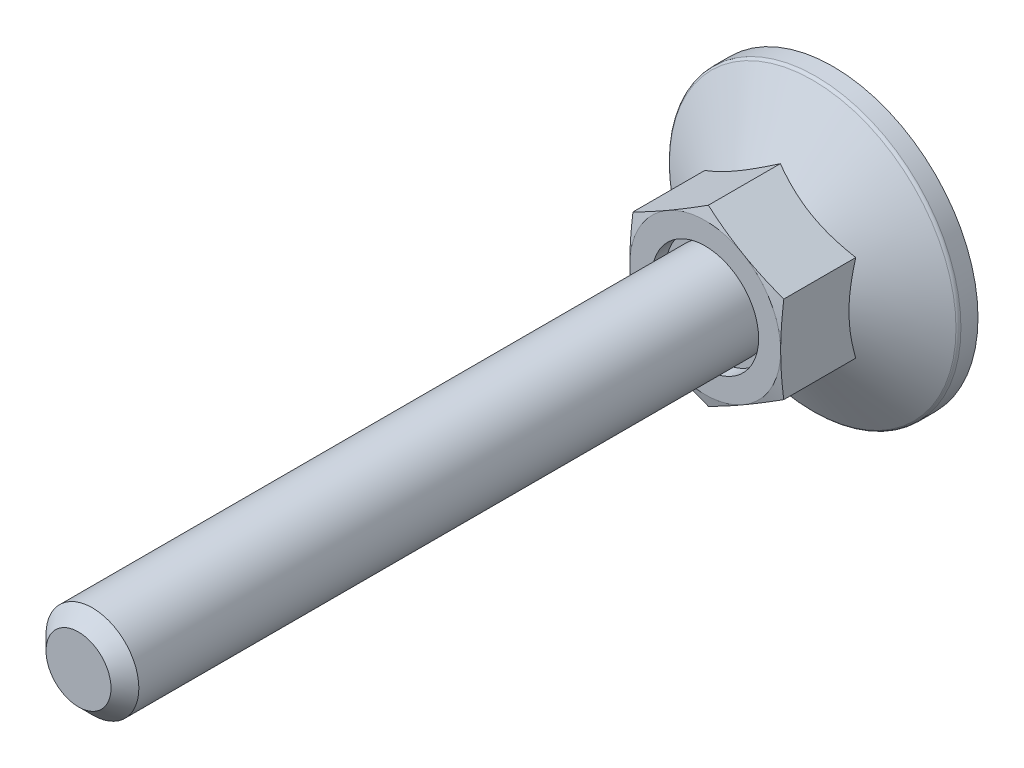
ISO-10303-21;
HEADER;
FILE_DESCRIPTION(('STEP AP214'),'2;1');
FILE_NAME('part.step','',(''),(''),'','','');
FILE_SCHEMA(('AUTOMOTIVE_DESIGN { 1 0 10303 214 1 1 1 1 }'));
ENDSEC;
DATA;
#1=APPLICATION_CONTEXT('core data for automotive mechanical design processes');
#2=APPLICATION_PROTOCOL_DEFINITION('international standard','automotive_design',2000,#1);
#3=PRODUCT_CONTEXT('',#1,'mechanical');
#4=PRODUCT('Part','Part','',(#3));
#5=PRODUCT_RELATED_PRODUCT_CATEGORY('part','',(#4));
#6=PRODUCT_DEFINITION_FORMATION('','',#4);
#7=PRODUCT_DEFINITION_CONTEXT('part definition',#1,'design');
#8=PRODUCT_DEFINITION('design','',#6,#7);
#9=PRODUCT_DEFINITION_SHAPE('','',#8);
#10=(LENGTH_UNIT() NAMED_UNIT(*) SI_UNIT(.MILLI.,.METRE.));
#11=(NAMED_UNIT(*) PLANE_ANGLE_UNIT() SI_UNIT($,.RADIAN.));
#12=(NAMED_UNIT(*) SI_UNIT($,.STERADIAN.) SOLID_ANGLE_UNIT());
#13=UNCERTAINTY_MEASURE_WITH_UNIT(LENGTH_MEASURE(1.E-05),#10,'distance_accuracy_value','');
#14=(GEOMETRIC_REPRESENTATION_CONTEXT(3) GLOBAL_UNCERTAINTY_ASSIGNED_CONTEXT((#13)) GLOBAL_UNIT_ASSIGNED_CONTEXT((#10,
#11,#12)) REPRESENTATION_CONTEXT('',''));
#15=CARTESIAN_POINT('',(0.,0.,0.));
#16=DIRECTION('',(0.,0.,1.));
#17=DIRECTION('',(1.,0.,0.));
#18=AXIS2_PLACEMENT_3D('',#15,#16,#17);
#19=CARTESIAN_POINT('',(0.,0.,9.8));
#20=DIRECTION('',(0.,0.,-1.));
#21=DIRECTION('',(0.,1.,0.));
#22=AXIS2_PLACEMENT_3D('',#19,#20,#21);
#23=PLANE('',#22);
#24=CARTESIAN_POINT('',(0.,0.,9.8));
#25=DIRECTION('',(0.,0.,-1.));
#26=DIRECTION('',(-1.,0.,0.));
#27=AXIS2_PLACEMENT_3D('',#24,#25,#26);
#28=CIRCLE('',#27,4.6);
#29=CARTESIAN_POINT('',(-4.6,0.,9.8));
#30=VERTEX_POINT('',#29);
#31=EDGE_CURVE('E346',#30,#30,#28,.F.);
#32=ORIENTED_EDGE('',*,*,#31,.T.);
#33=EDGE_LOOP('',(#32));
#34=FACE_BOUND('',#33,.T.);
#35=CARTESIAN_POINT('',(0.,0.,9.8));
#36=DIRECTION('',(0.,0.,-1.));
#37=DIRECTION('',(-1.,0.,0.));
#38=AXIS2_PLACEMENT_3D('',#35,#36,#37);
#39=CIRCLE('',#38,4.);
#40=CARTESIAN_POINT('',(-4.,0.,9.8));
#41=VERTEX_POINT('',#40);
#42=EDGE_CURVE('E349',#41,#41,#39,.F.);
#43=ORIENTED_EDGE('',*,*,#42,.F.);
#44=EDGE_LOOP('',(#43));
#45=FACE_BOUND('',#44,.T.);
#46=ADVANCED_FACE('F14',(#34,#45),#23,.F.);
#47=CARTESIAN_POINT('',(7.8,0.,0.));
#48=DIRECTION('',(0.,0.,1.));
#49=DIRECTION('',(0.,-1.,0.));
#50=AXIS2_PLACEMENT_3D('',#47,#48,#49);
#51=PLANE('',#50);
#52=DIRECTION('',(1.,0.,0.));
#53=VECTOR('',#52,1.);
#54=CARTESIAN_POINT('',(1.,-1.,0.));
#55=LINE('',#54,#53);
#56=CARTESIAN_POINT('',(1.,-1.,0.));
#57=VERTEX_POINT('',#56);
#58=CARTESIAN_POINT('',(4.16666666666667,-1.,0.));
#59=VERTEX_POINT('',#58);
#60=EDGE_CURVE('E697',#57,#59,#55,.T.);
#61=ORIENTED_EDGE('',*,*,#60,.T.);
#62=DIRECTION('',(0.,-1.,0.));
#63=VECTOR('',#62,1.);
#64=CARTESIAN_POINT('',(4.16666666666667,0.,0.));
#65=LINE('',#64,#63);
#66=CARTESIAN_POINT('',(4.16666666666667,1.,0.));
#67=VERTEX_POINT('',#66);
#68=EDGE_CURVE('E351',#67,#59,#65,.T.);
#69=ORIENTED_EDGE('',*,*,#68,.F.);
#70=DIRECTION('',(-1.,0.,0.));
#71=VECTOR('',#70,1.);
#72=CARTESIAN_POINT('',(4.16666666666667,1.,0.));
#73=LINE('',#72,#71);
#74=CARTESIAN_POINT('',(1.,1.,0.));
#75=VERTEX_POINT('',#74);
#76=EDGE_CURVE('E700',#67,#75,#73,.T.);
#77=ORIENTED_EDGE('',*,*,#76,.T.);
#78=DIRECTION('',(0.,1.,0.));
#79=VECTOR('',#78,1.);
#80=CARTESIAN_POINT('',(1.,1.,0.));
#81=LINE('',#80,#79);
#82=CARTESIAN_POINT('',(1.,4.16666666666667,0.));
#83=VERTEX_POINT('',#82);
#84=EDGE_CURVE('E703',#75,#83,#81,.T.);
#85=ORIENTED_EDGE('',*,*,#84,.T.);
#86=DIRECTION('',(-1.,0.,0.));
#87=VECTOR('',#86,1.);
#88=CARTESIAN_POINT('',(1.,4.16666666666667,0.));
#89=LINE('',#88,#87);
#90=CARTESIAN_POINT('',(-1.,4.16666666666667,0.));
#91=VERTEX_POINT('',#90);
#92=EDGE_CURVE('E706',#83,#91,#89,.T.);
#93=ORIENTED_EDGE('',*,*,#92,.T.);
#94=DIRECTION('',(0.,-1.,0.));
#95=VECTOR('',#94,1.);
#96=CARTESIAN_POINT('',(-1.,4.16666666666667,0.));
#97=LINE('',#96,#95);
#98=CARTESIAN_POINT('',(-1.,1.,0.));
#99=VERTEX_POINT('',#98);
#100=EDGE_CURVE('E175',#91,#99,#97,.T.);
#101=ORIENTED_EDGE('',*,*,#100,.T.);
#102=DIRECTION('',(-1.,0.,0.));
#103=VECTOR('',#102,1.);
#104=CARTESIAN_POINT('',(-1.,1.,0.));
#105=LINE('',#104,#103);
#106=CARTESIAN_POINT('',(-4.16666666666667,1.,0.));
#107=VERTEX_POINT('',#106);
#108=EDGE_CURVE('E29',#99,#107,#105,.T.);
#109=ORIENTED_EDGE('',*,*,#108,.T.);
#110=DIRECTION('',(0.,-1.,0.));
#111=VECTOR('',#110,1.);
#112=CARTESIAN_POINT('',(-4.16666666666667,1.,0.));
#113=LINE('',#112,#111);
#114=CARTESIAN_POINT('',(-4.16666666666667,-1.,0.));
#115=VERTEX_POINT('',#114);
#116=EDGE_CURVE('E179',#107,#115,#113,.T.);
#117=ORIENTED_EDGE('',*,*,#116,.T.);
#118=DIRECTION('',(1.,0.,0.));
#119=VECTOR('',#118,1.);
#120=CARTESIAN_POINT('',(-4.16666666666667,-1.,0.));
#121=LINE('',#120,#119);
#122=CARTESIAN_POINT('',(-1.,-1.,0.));
#123=VERTEX_POINT('',#122);
#124=EDGE_CURVE('E685',#115,#123,#121,.T.);
#125=ORIENTED_EDGE('',*,*,#124,.T.);
#126=DIRECTION('',(0.,-1.,0.));
#127=VECTOR('',#126,1.);
#128=CARTESIAN_POINT('',(-1.,-1.,0.));
#129=LINE('',#128,#127);
#130=CARTESIAN_POINT('',(-1.,-4.16666666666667,0.));
#131=VERTEX_POINT('',#130);
#132=EDGE_CURVE('E688',#123,#131,#129,.T.);
#133=ORIENTED_EDGE('',*,*,#132,.T.);
#134=DIRECTION('',(1.,0.,0.));
#135=VECTOR('',#134,1.);
#136=CARTESIAN_POINT('',(-1.,-4.16666666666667,0.));
#137=LINE('',#136,#135);
#138=CARTESIAN_POINT('',(1.,-4.16666666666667,0.));
#139=VERTEX_POINT('',#138);
#140=EDGE_CURVE('E691',#131,#139,#137,.T.);
#141=ORIENTED_EDGE('',*,*,#140,.T.);
#142=DIRECTION('',(0.,1.,0.));
#143=VECTOR('',#142,1.);
#144=CARTESIAN_POINT('',(1.,-4.16666666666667,0.));
#145=LINE('',#144,#143);
#146=EDGE_CURVE('E694',#139,#57,#145,.T.);
#147=ORIENTED_EDGE('',*,*,#146,.T.);
#148=EDGE_LOOP('',(#61,#69,#77,#85,#93,#101,#109,#117,#125,#133,#141,#147));
#149=FACE_BOUND('',#148,.T.);
#150=CARTESIAN_POINT('',(0.,0.,0.));
#151=DIRECTION('',(0.,0.,-1.));
#152=DIRECTION('',(0.,1.,0.));
#153=AXIS2_PLACEMENT_3D('',#150,#151,#152);
#154=CIRCLE('',#153,12.5);
#155=CARTESIAN_POINT('',(0.,12.5,0.));
#156=VERTEX_POINT('',#155);
#157=EDGE_CURVE('E180',#156,#156,#154,.T.);
#158=ORIENTED_EDGE('',*,*,#157,.T.);
#159=EDGE_LOOP('',(#158));
#160=FACE_BOUND('',#159,.T.);
#161=ADVANCED_FACE('F294',(#149,#160),#51,.F.);
#162=CARTESIAN_POINT('',(0.,7.50555349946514,48.));
#163=DIRECTION('',(0.5,-0.866025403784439,0.));
#164=DIRECTION('',(0.866025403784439,0.5,0.));
#165=AXIS2_PLACEMENT_3D('',#162,#163,#164);
#166=PLANE('',#165);
#167=CARTESIAN_POINT('',(-6.5002,3.75266127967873,4.53347836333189));
#168=CARTESIAN_POINT('',(-6.35732254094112,3.83515161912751,4.58109719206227));
#169=CARTESIAN_POINT('',(-6.21391236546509,3.91794952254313,4.62655491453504));
#170=CARTESIAN_POINT('',(-5.92592736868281,4.08421773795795,4.7125529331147));
#171=CARTESIAN_POINT('',(-5.78135207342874,4.16768832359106,4.75309110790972));
#172=CARTESIAN_POINT('',(-5.34531134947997,4.41943655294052,4.86653061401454));
#173=CARTESIAN_POINT('',(-5.05212471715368,4.5887079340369,4.93105380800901));
#174=CARTESIAN_POINT('',(-4.61337625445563,4.84201947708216,5.00671503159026));
#175=CARTESIAN_POINT('',(-4.46912536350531,4.92530276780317,5.02826875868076));
#176=CARTESIAN_POINT('',(-4.17997178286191,5.09224566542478,5.06441130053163));
#177=CARTESIAN_POINT('',(-4.03506915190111,5.17590523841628,5.07900073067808));
#178=CARTESIAN_POINT('',(-3.74501222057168,5.34336968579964,5.1008428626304));
#179=CARTESIAN_POINT('',(-3.59985839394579,5.42717428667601,5.10810389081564));
#180=CARTESIAN_POINT('',(-3.30942466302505,5.59485627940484,5.11514131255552));
#181=CARTESIAN_POINT('',(-3.16414476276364,5.6787336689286,5.11491793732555));
#182=CARTESIAN_POINT('',(-2.7661240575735,5.90853103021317,5.10401815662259));
#183=CARTESIAN_POINT('',(-2.51351353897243,6.05437578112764,5.08571979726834));
#184=CARTESIAN_POINT('',(-2.00997032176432,6.34509659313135,5.02769527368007));
#185=CARTESIAN_POINT('',(-1.75903939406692,6.48997163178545,4.98794927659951));
#186=CARTESIAN_POINT('',(-1.25448277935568,6.78127752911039,4.8885957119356));
#187=CARTESIAN_POINT('',(-1.00092075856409,6.92767163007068,4.82856718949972));
#188=CARTESIAN_POINT('',(-0.497578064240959,7.21827667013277,4.69232662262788));
#189=CARTESIAN_POINT('',(-0.247790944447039,7.36249133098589,4.61614658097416));
#190=CARTESIAN_POINT('',(0.000199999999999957,7.50566896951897,4.53347836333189));
#191=B_SPLINE_CURVE_WITH_KNOTS('',3,(#167,#168,#169,#170,#171,#172,#173,#174,#175,#176,#177,
#178,#179,#180,#181,#182,#183,#184,#185,#186,#187,#188,#189,#190),.UNSPECIFIED.,.F.,.F.,(4,2,2,
2,2,2,2,2,2,2,2,4),(0.,0.515105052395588,1.03043143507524,2.06322554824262,2.56697389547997,
3.07067772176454,3.57380860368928,4.0769239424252,4.9527935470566,5.82947446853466,
6.72559912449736,7.61996451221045),.UNSPECIFIED.);
#192=CARTESIAN_POINT('',(-6.5,3.75277674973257,4.53354503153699));
#193=VERTEX_POINT('',#192);
#194=CARTESIAN_POINT('',(0.,7.50555349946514,4.53354503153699));
#195=VERTEX_POINT('',#194);
#196=EDGE_CURVE('E251',#193,#195,#191,.T.);
#197=ORIENTED_EDGE('',*,*,#196,.F.);
#198=DIRECTION('',(0.,0.,-1.));
#199=VECTOR('',#198,1.);
#200=CARTESIAN_POINT('',(-6.5,3.75277674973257,48.));
#201=LINE('',#200,#199);
#202=CARTESIAN_POINT('',(-6.5,3.75277674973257,10.730562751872));
#203=VERTEX_POINT('',#202);
#204=EDGE_CURVE('E408',#203,#193,#201,.T.);
#205=ORIENTED_EDGE('',*,*,#204,.F.);
#206=CARTESIAN_POINT('',(0.0002,7.50566896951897,10.7305318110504));
#207=CARTESIAN_POINT('',(-0.26974524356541,7.34981601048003,10.772310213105));
#208=CARTESIAN_POINT('',(-0.540179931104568,7.19368047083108,10.8102381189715));
#209=CARTESIAN_POINT('',(-1.08200437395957,6.88085798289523,10.8768739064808));
#210=CARTESIAN_POINT('',(-1.35339447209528,6.72417083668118,10.9055780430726));
#211=CARTESIAN_POINT('',(-1.8954842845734,6.41119513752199,10.9520905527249));
#212=CARTESIAN_POINT('',(-2.16618033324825,6.25490870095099,10.9699543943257));
#213=CARTESIAN_POINT('',(-2.70791763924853,5.94213652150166,10.9939079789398));
#214=CARTESIAN_POINT('',(-2.97895881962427,5.78565082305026,11.));
#215=CARTESIAN_POINT('',(-3.52104118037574,5.47267942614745,11.));
#216=CARTESIAN_POINT('',(-3.79208236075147,5.31619372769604,10.9939079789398));
#217=CARTESIAN_POINT('',(-4.33381966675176,5.00342154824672,10.9699543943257));
#218=CARTESIAN_POINT('',(-4.60451571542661,4.84713511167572,10.9520905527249));
#219=CARTESIAN_POINT('',(-5.14660552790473,4.53415941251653,10.9055780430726));
#220=CARTESIAN_POINT('',(-5.41799562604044,4.37747226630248,10.8768739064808));
#221=CARTESIAN_POINT('',(-5.95982006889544,4.06464977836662,10.8102381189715));
#222=CARTESIAN_POINT('',(-6.23025475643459,3.90851423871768,10.772310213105));
#223=CARTESIAN_POINT('',(-6.5002,3.75266127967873,10.7305318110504));
#224=B_SPLINE_CURVE_WITH_KNOTS('',3,(#206,#207,#208,#209,#210,#211,#212,#213,#214,#215,#216,
#217,#218,#219,#220,#221,#222,#223),.UNSPECIFIED.,.F.,.F.,(4,2,2,2,2,2,2,2,4),(0.,
0.943529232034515,1.88744107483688,2.82648138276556,3.76533995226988,4.70419852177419,
5.64323882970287,6.58715067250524,7.53067990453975),.UNSPECIFIED.);
#225=CARTESIAN_POINT('',(-3.25,5.62916512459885,11.));
#226=VERTEX_POINT('',#225);
#227=EDGE_CURVE('E281',#226,#203,#224,.T.);
#228=ORIENTED_EDGE('',*,*,#227,.F.);
#229=CARTESIAN_POINT('',(0.,7.50555349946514,10.730562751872));
#230=VERTEX_POINT('',#229);
#231=EDGE_CURVE('E372',#230,#226,#224,.T.);
#232=ORIENTED_EDGE('',*,*,#231,.F.);
#233=DIRECTION('',(0.,0.,-1.));
#234=VECTOR('',#233,1.);
#235=CARTESIAN_POINT('',(0.,7.50555349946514,48.));
#236=LINE('',#235,#234);
#237=EDGE_CURVE('E392',#230,#195,#236,.T.);
#238=ORIENTED_EDGE('',*,*,#237,.T.);
#239=EDGE_LOOP('',(#197,#205,#228,#232,#238));
#240=FACE_BOUND('',#239,.T.);
#241=ADVANCED_FACE('F223',(#240),#166,.F.);
#242=CARTESIAN_POINT('',(6.5,3.75277674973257,48.));
#243=DIRECTION('',(-0.5,-0.866025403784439,0.));
#244=DIRECTION('',(0.866025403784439,-0.5,0.));
#245=AXIS2_PLACEMENT_3D('',#242,#243,#244);
#246=PLANE('',#245);
#247=CARTESIAN_POINT('',(-0.0002,7.50566896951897,4.53347836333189));
#248=CARTESIAN_POINT('',(0.142677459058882,7.4231786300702,4.58109719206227));
#249=CARTESIAN_POINT('',(0.286087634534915,7.34038072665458,4.62655491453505));
#250=CARTESIAN_POINT('',(0.574072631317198,7.17411251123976,4.71255293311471));
#251=CARTESIAN_POINT('',(0.718647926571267,7.09064192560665,4.75309110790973));
#252=CARTESIAN_POINT('',(1.15468865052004,6.83889369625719,4.86653061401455));
#253=CARTESIAN_POINT('',(1.44787528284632,6.66962231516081,4.93105380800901));
#254=CARTESIAN_POINT('',(1.88662374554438,6.41631077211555,5.00671503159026));
#255=CARTESIAN_POINT('',(2.03087463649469,6.33302748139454,5.02826875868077));
#256=CARTESIAN_POINT('',(2.32002821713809,6.16608458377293,5.06441130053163));
#257=CARTESIAN_POINT('',(2.46493084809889,6.08242501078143,5.07900073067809));
#258=CARTESIAN_POINT('',(2.75498777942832,5.91496056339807,5.10084286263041));
#259=CARTESIAN_POINT('',(2.90014160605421,5.8311559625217,5.10810389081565));
#260=CARTESIAN_POINT('',(3.19057533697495,5.66347396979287,5.11514131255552));
#261=CARTESIAN_POINT('',(3.33585523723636,5.5795965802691,5.11491793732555));
#262=CARTESIAN_POINT('',(3.73387594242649,5.34979921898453,5.10401815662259));
#263=CARTESIAN_POINT('',(3.98648646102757,5.20395446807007,5.08571979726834));
#264=CARTESIAN_POINT('',(4.49002967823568,4.91323365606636,5.02769527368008));
#265=CARTESIAN_POINT('',(4.74096060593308,4.76835861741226,4.98794927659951));
#266=CARTESIAN_POINT('',(5.24551722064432,4.47705272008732,4.8885957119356));
#267=CARTESIAN_POINT('',(5.49907924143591,4.33065861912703,4.82856718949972));
#268=CARTESIAN_POINT('',(6.00242193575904,4.04005357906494,4.69232662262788));
#269=CARTESIAN_POINT('',(6.25220905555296,3.89583891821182,4.61614658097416));
#270=CARTESIAN_POINT('',(6.5002,3.75266127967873,4.53347836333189));
#271=B_SPLINE_CURVE_WITH_KNOTS('',3,(#247,#248,#249,#250,#251,#252,#253,#254,#255,#256,#257,
#258,#259,#260,#261,#262,#263,#264,#265,#266,#267,#268,#269,#270),.UNSPECIFIED.,.F.,.F.,(4,2,2,
2,2,2,2,2,2,2,2,4),(0.,0.515105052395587,1.03043143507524,2.06322554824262,2.56697389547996,
3.07067772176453,3.57380860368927,4.0769239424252,4.9527935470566,5.82947446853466,
6.72559912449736,7.61996451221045),.UNSPECIFIED.);
#272=CARTESIAN_POINT('',(6.5,3.75277674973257,4.53354503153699));
#273=VERTEX_POINT('',#272);
#274=EDGE_CURVE('E37',#195,#273,#271,.T.);
#275=ORIENTED_EDGE('',*,*,#274,.F.);
#276=ORIENTED_EDGE('',*,*,#237,.F.);
#277=CARTESIAN_POINT('',(6.5002,3.75266127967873,10.7305318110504));
#278=CARTESIAN_POINT('',(6.23025475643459,3.90851423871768,10.772310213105));
#279=CARTESIAN_POINT('',(5.95982006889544,4.06464977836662,10.8102381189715));
#280=CARTESIAN_POINT('',(5.41799562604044,4.37747226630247,10.8768739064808));
#281=CARTESIAN_POINT('',(5.14660552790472,4.53415941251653,10.9055780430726));
#282=CARTESIAN_POINT('',(4.60451571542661,4.84713511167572,10.9520905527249));
#283=CARTESIAN_POINT('',(4.33381966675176,5.00342154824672,10.9699543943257));
#284=CARTESIAN_POINT('',(3.79208236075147,5.31619372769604,10.9939079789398));
#285=CARTESIAN_POINT('',(3.52104118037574,5.47267942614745,11.));
#286=CARTESIAN_POINT('',(2.97895881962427,5.78565082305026,11.));
#287=CARTESIAN_POINT('',(2.70791763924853,5.94213652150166,10.9939079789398));
#288=CARTESIAN_POINT('',(2.16618033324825,6.25490870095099,10.9699543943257));
#289=CARTESIAN_POINT('',(1.89548428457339,6.41119513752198,10.9520905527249));
#290=CARTESIAN_POINT('',(1.35339447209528,6.72417083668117,10.9055780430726));
#291=CARTESIAN_POINT('',(1.08200437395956,6.88085798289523,10.8768739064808));
#292=CARTESIAN_POINT('',(0.540179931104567,7.19368047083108,10.8102381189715));
#293=CARTESIAN_POINT('',(0.26974524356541,7.34981601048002,10.772310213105));
#294=CARTESIAN_POINT('',(-0.000199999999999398,7.50566896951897,10.7305318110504));
#295=B_SPLINE_CURVE_WITH_KNOTS('',3,(#277,#278,#279,#280,#281,#282,#283,#284,#285,#286,#287,
#288,#289,#290,#291,#292,#293,#294),.UNSPECIFIED.,.F.,.F.,(4,2,2,2,2,2,2,2,4),(0.,
0.943529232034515,1.88744107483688,2.82648138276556,3.76533995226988,4.70419852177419,
5.64323882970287,6.58715067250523,7.53067990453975),.UNSPECIFIED.);
#296=CARTESIAN_POINT('',(3.25,5.62916512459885,11.));
#297=VERTEX_POINT('',#296);
#298=EDGE_CURVE('E264',#297,#230,#295,.T.);
#299=ORIENTED_EDGE('',*,*,#298,.F.);
#300=CARTESIAN_POINT('',(6.5,3.75277674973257,10.730562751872));
#301=VERTEX_POINT('',#300);
#302=EDGE_CURVE('E273',#301,#297,#295,.T.);
#303=ORIENTED_EDGE('',*,*,#302,.F.);
#304=DIRECTION('',(0.,0.,-1.));
#305=VECTOR('',#304,1.);
#306=CARTESIAN_POINT('',(6.5,3.75277674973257,48.));
#307=LINE('',#306,#305);
#308=EDGE_CURVE('E395',#301,#273,#307,.T.);
#309=ORIENTED_EDGE('',*,*,#308,.T.);
#310=EDGE_LOOP('',(#275,#276,#299,#303,#309));
#311=FACE_BOUND('',#310,.T.);
#312=ADVANCED_FACE('F257',(#311),#246,.F.);
#313=CARTESIAN_POINT('',(6.5,-3.75277674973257,48.));
#314=DIRECTION('',(-1.,0.,0.));
#315=DIRECTION('',(0.,-1.,0.));
#316=AXIS2_PLACEMENT_3D('',#313,#314,#315);
#317=PLANE('',#316);
#318=CARTESIAN_POINT('',(6.5,10.067414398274,1.94823609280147));
#319=CARTESIAN_POINT('',(6.5,9.78352438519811,2.08589580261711));
#320=CARTESIAN_POINT('',(6.5,9.49898106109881,2.22223138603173));
#321=CARTESIAN_POINT('',(6.5,8.92824011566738,2.49150895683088));
#322=CARTESIAN_POINT('',(6.5,8.64204224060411,2.62445040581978));
#323=CARTESIAN_POINT('',(6.5,8.06616487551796,2.88686541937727));
#324=CARTESIAN_POINT('',(6.5,7.77647490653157,3.01631606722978));
#325=CARTESIAN_POINT('',(6.5,7.19478507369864,3.26989907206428));
#326=CARTESIAN_POINT('',(6.5,6.90278532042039,3.39403168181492));
#327=CARTESIAN_POINT('',(6.5,6.30684739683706,3.63934571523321));
#328=CARTESIAN_POINT('',(6.5,6.00282105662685,3.76031411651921));
#329=CARTESIAN_POINT('',(6.5,5.39120706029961,3.99306391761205));
#330=CARTESIAN_POINT('',(6.5,5.08361900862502,4.10484428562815));
#331=CARTESIAN_POINT('',(6.5,4.46497231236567,4.31627594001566));
#332=CARTESIAN_POINT('',(6.5,4.15392216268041,4.41595183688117));
#333=CARTESIAN_POINT('',(6.5,3.52735818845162,4.59996747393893));
#334=CARTESIAN_POINT('',(6.5,3.21184580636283,4.68431205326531));
#335=CARTESIAN_POINT('',(6.5,2.57783458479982,4.83319256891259));
#336=CARTESIAN_POINT('',(6.5,2.25935972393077,4.89782898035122));
#337=CARTESIAN_POINT('',(6.5,1.61842059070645,5.00357646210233));
#338=CARTESIAN_POINT('',(6.5,1.29595672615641,5.04468991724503));
#339=CARTESIAN_POINT('',(6.5,0.812693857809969,5.08598811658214));
#340=CARTESIAN_POINT('',(6.5,0.652724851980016,5.09635596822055));
#341=CARTESIAN_POINT('',(6.5,0.332484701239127,5.11032435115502));
#342=CARTESIAN_POINT('',(6.5,0.172213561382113,5.11392499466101));
#343=CARTESIAN_POINT('',(6.5,-0.148338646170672,5.11426557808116));
#344=CARTESIAN_POINT('',(6.5,-0.30861971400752,5.11100536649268));
#345=CARTESIAN_POINT('',(6.5,-0.628902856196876,5.09770543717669));
#346=CARTESIAN_POINT('',(6.5,-0.788904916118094,5.08766537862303));
#347=CARTESIAN_POINT('',(6.5,-1.17366735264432,5.05558094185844));
#348=CARTESIAN_POINT('',(6.5,-1.39816400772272,5.03030719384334));
#349=CARTESIAN_POINT('',(6.5,-1.84547349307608,4.96779217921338));
#350=CARTESIAN_POINT('',(6.5,-2.06828609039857,4.93054928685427));
#351=CARTESIAN_POINT('',(6.5,-2.73393776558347,4.80284369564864));
#352=CARTESIAN_POINT('',(6.5,-3.17375537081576,4.6964262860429));
#353=CARTESIAN_POINT('',(6.5,-3.83171733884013,4.51203063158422));
#354=CARTESIAN_POINT('',(6.5,-4.05327258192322,4.44552609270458));
#355=CARTESIAN_POINT('',(6.5,-4.49422901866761,4.30565892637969));
#356=CARTESIAN_POINT('',(6.5,-4.71363019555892,4.23229624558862));
#357=CARTESIAN_POINT('',(6.5,-5.15035386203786,4.07988627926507));
#358=CARTESIAN_POINT('',(6.5,-5.3676769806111,4.00084077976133));
#359=CARTESIAN_POINT('',(6.5,-5.80052072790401,3.83799065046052));
#360=CARTESIAN_POINT('',(6.5,-6.01604140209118,3.75418614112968));
#361=CARTESIAN_POINT('',(6.5,-6.61842771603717,3.51353035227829));
#362=CARTESIAN_POINT('',(6.5,-7.00350435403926,3.35220459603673));
#363=CARTESIAN_POINT('',(6.5,-7.76959629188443,3.02014813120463));
#364=CARTESIAN_POINT('',(6.5,-8.15061109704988,2.84941629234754));
#365=CARTESIAN_POINT('',(6.5,-8.90957192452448,2.50088582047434));
#366=CARTESIAN_POINT('',(6.5,-9.28751663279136,2.3230843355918));
#367=CARTESIAN_POINT('',(6.5,-10.0408394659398,1.96218611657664));
#368=CARTESIAN_POINT('',(6.5,-10.4162177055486,1.77908962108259));
#369=CARTESIAN_POINT('',(6.5,-11.1655631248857,1.40849620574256));
#370=CARTESIAN_POINT('',(6.5,-11.5395269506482,1.22099251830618));
#371=CARTESIAN_POINT('',(6.5,-12.2858210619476,0.842758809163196));
#372=CARTESIAN_POINT('',(6.5,-12.6581513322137,0.652028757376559));
#373=CARTESIAN_POINT('',(6.5,-13.4013949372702,0.268043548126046));
#374=CARTESIAN_POINT('',(6.5,-13.7723085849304,0.0747889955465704));
#375=CARTESIAN_POINT('',(6.5,-14.5130449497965,-0.313800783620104));
#376=CARTESIAN_POINT('',(6.5,-14.8828676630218,-0.509136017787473));
#377=CARTESIAN_POINT('',(6.5,-15.9085714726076,-1.05391022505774));
#378=CARTESIAN_POINT('',(6.5,-16.5634819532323,-1.40517623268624));
#379=CARTESIAN_POINT('',(6.5,-17.8712672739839,-2.11157255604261));
#380=CARTESIAN_POINT('',(6.5,-18.5241419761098,-2.4667031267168));
#381=CARTESIAN_POINT('',(6.5,-19.8261496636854,-3.17862531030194));
#382=CARTESIAN_POINT('',(6.5,-20.475287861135,-3.53540739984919));
#383=CARTESIAN_POINT('',(6.5,-21.7722968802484,-4.25114422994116));
#384=CARTESIAN_POINT('',(6.5,-22.4201678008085,-4.61009879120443));
#385=CARTESIAN_POINT('',(6.5,-23.0675997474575,-4.9698379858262));
#386=B_SPLINE_CURVE_WITH_KNOTS('',3,(#318,#319,#320,#321,#322,#323,#324,#325,#326,#327,#328,
#329,#330,#331,#332,#333,#334,#335,#336,#337,#338,#339,#340,#341,#342,#343,#344,#345,#346,#347,
#348,#349,#350,#351,#352,#353,#354,#355,#356,#357,#358,#359,#360,#361,#362,#363,#364,#365,#366,
#367,#368,#369,#370,#371,#372,#373,#374,#375,#376,#377,#378,#379,#380,#381,#382,#383,#384,#385),
.UNSPECIFIED.,.F.,.F.,(4,2,2,2,2,2,2,2,2,2,2,2,2,2,2,2,2,2,2,2,2,2,2,2,2,2,2,2,2,2,2,2,2,4),(0.,
0.946528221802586,1.89320566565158,2.84505559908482,3.79686024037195,4.77837094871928,
5.75999172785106,6.73958204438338,7.71886262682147,8.69306383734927,9.66716626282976,
10.1479587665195,10.6287432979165,11.1095384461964,11.5903577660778,12.267719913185,
12.9451741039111,14.3007885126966,14.9946950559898,15.6886069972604,16.3823017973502,
17.0759790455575,18.3282990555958,19.5807698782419,20.8337511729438,22.086676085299,
23.3416700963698,24.5966758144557,25.8513861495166,27.1061010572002,29.335578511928,
31.5652039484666,33.7873748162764,36.0093647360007),.UNSPECIFIED.);
#387=CARTESIAN_POINT('',(6.5,-3.75277674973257,4.53354503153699));
#388=VERTEX_POINT('',#387);
#389=EDGE_CURVE('E240',#273,#388,#386,.T.);
#390=ORIENTED_EDGE('',*,*,#389,.F.);
#391=ORIENTED_EDGE('',*,*,#308,.F.);
#392=CARTESIAN_POINT('',(6.5,9.92747995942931,9.56215186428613));
#393=CARTESIAN_POINT('',(6.5,9.63259364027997,9.62823955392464));
#394=CARTESIAN_POINT('',(6.5,9.33752287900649,9.69351898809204));
#395=CARTESIAN_POINT('',(6.5,8.7469218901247,9.82202506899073));
#396=CARTESIAN_POINT('',(6.5,8.45139164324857,9.88525162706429));
#397=CARTESIAN_POINT('',(6.5,7.85951636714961,10.0092707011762));
#398=CARTESIAN_POINT('',(6.5,7.56317082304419,10.0700607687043));
#399=CARTESIAN_POINT('',(6.5,6.96986292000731,10.1885506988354));
#400=CARTESIAN_POINT('',(6.5,6.67290056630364,10.2462505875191));
#401=CARTESIAN_POINT('',(6.5,6.08062010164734,10.3573796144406));
#402=CARTESIAN_POINT('',(6.5,5.78530770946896,10.4108390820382));
#403=CARTESIAN_POINT('',(6.5,5.19387740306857,10.513090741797));
#404=CARTESIAN_POINT('',(6.5,4.89775950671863,10.5618830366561));
#405=CARTESIAN_POINT('',(6.5,4.30466070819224,10.6537017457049));
#406=CARTESIAN_POINT('',(6.5,4.00767991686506,10.6967288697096));
#407=CARTESIAN_POINT('',(6.5,3.4127732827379,10.7757492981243));
#408=CARTESIAN_POINT('',(6.5,3.1148474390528,10.8117425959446));
#409=CARTESIAN_POINT('',(6.5,2.51468954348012,10.8756761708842));
#410=CARTESIAN_POINT('',(6.5,2.21244707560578,10.9035201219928));
#411=CARTESIAN_POINT('',(6.5,1.60720229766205,10.9492341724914));
#412=CARTESIAN_POINT('',(6.5,1.30420000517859,10.9671045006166));
#413=CARTESIAN_POINT('',(6.5,0.697875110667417,10.9918290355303));
#414=CARTESIAN_POINT('',(6.5,0.394552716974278,10.9986882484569));
#415=CARTESIAN_POINT('',(6.5,-0.212135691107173,11.0009688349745));
#416=CARTESIAN_POINT('',(6.5,-0.515501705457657,10.9963902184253));
#417=CARTESIAN_POINT('',(6.5,-1.12295501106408,10.9760526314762));
#418=CARTESIAN_POINT('',(6.5,-1.42704091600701,10.9602530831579));
#419=CARTESIAN_POINT('',(6.5,-2.03449758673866,10.9183754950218));
#420=CARTESIAN_POINT('',(6.5,-2.33786833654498,10.8922972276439));
#421=CARTESIAN_POINT('',(6.5,-2.94389214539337,10.8311794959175));
#422=CARTESIAN_POINT('',(6.5,-3.24654460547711,10.7961341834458));
#423=CARTESIAN_POINT('',(6.5,-3.85087551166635,10.7185406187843));
#424=CARTESIAN_POINT('',(6.5,-4.15255395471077,10.6759923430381));
#425=CARTESIAN_POINT('',(6.5,-4.73502363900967,10.5877746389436));
#426=CARTESIAN_POINT('',(6.5,-5.01587505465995,10.5424985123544));
#427=CARTESIAN_POINT('',(6.5,-5.57683763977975,10.4475514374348));
#428=CARTESIAN_POINT('',(6.5,-5.85694878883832,10.3978803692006));
#429=CARTESIAN_POINT('',(6.5,-6.41653333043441,10.2949474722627));
#430=CARTESIAN_POINT('',(6.5,-6.69600666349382,10.241685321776));
#431=CARTESIAN_POINT('',(6.5,-7.2543793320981,10.1322258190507));
#432=CARTESIAN_POINT('',(6.5,-7.53327866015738,10.0760284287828));
#433=CARTESIAN_POINT('',(6.5,-8.36936246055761,9.90383082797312));
#434=CARTESIAN_POINT('',(6.5,-8.92580841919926,9.78424858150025));
#435=CARTESIAN_POINT('',(6.5,-10.037220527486,9.53861051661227));
#436=CARTESIAN_POINT('',(6.5,-10.5921867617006,9.41255507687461));
#437=CARTESIAN_POINT('',(6.5,-11.6956125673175,9.15714489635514));
#438=CARTESIAN_POINT('',(6.5,-12.2440824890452,9.02783474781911));
#439=CARTESIAN_POINT('',(6.5,-13.3402571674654,8.76597711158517));
#440=CARTESIAN_POINT('',(6.5,-13.8879619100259,8.63342956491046));
#441=CARTESIAN_POINT('',(6.5,-14.9821103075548,8.36610757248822));
#442=CARTESIAN_POINT('',(6.5,-15.5285546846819,8.23133607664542));
#443=CARTESIAN_POINT('',(6.5,-16.620967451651,7.95995280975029));
#444=CARTESIAN_POINT('',(6.5,-17.166935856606,7.82334109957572));
#445=CARTESIAN_POINT('',(6.5,-17.7127383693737,7.6860776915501));
#446=B_SPLINE_CURVE_WITH_KNOTS('',3,(#392,#393,#394,#395,#396,#397,#398,#399,#400,#401,#402,
#403,#404,#405,#406,#407,#408,#409,#410,#411,#412,#413,#414,#415,#416,#417,#418,#419,#420,#421,
#422,#423,#424,#425,#426,#427,#428,#429,#430,#431,#432,#433,#434,#435,#436,#437,#438,#439,#440,
#441,#442,#443,#444,#445),.UNSPECIFIED.,.F.,.F.,(4,2,2,2,2,2,2,2,2,2,2,2,2,2,2,2,2,2,2,2,2,2,2,
2,2,2,4),(0.,0.906607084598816,1.8132532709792,2.72078883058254,3.62831672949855,
4.52862337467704,5.42891020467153,6.32908608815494,7.22926281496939,8.13968571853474,
9.05008774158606,9.96007573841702,10.8700629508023,11.7833577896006,12.6966728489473,
13.6105850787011,14.5245001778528,15.3778915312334,16.2313061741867,17.084797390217,
17.9382996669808,19.6456836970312,21.3529679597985,23.0434756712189,24.7340142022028,
26.4224665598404,28.1108631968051),.UNSPECIFIED.);
#447=CARTESIAN_POINT('',(6.5,0.,11.));
#448=VERTEX_POINT('',#447);
#449=EDGE_CURVE('E275',#448,#301,#446,.F.);
#450=ORIENTED_EDGE('',*,*,#449,.F.);
#451=CARTESIAN_POINT('',(6.5,-3.75277674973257,10.730562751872));
#452=VERTEX_POINT('',#451);
#453=EDGE_CURVE('E274',#452,#448,#446,.F.);
#454=ORIENTED_EDGE('',*,*,#453,.F.);
#455=DIRECTION('',(0.,0.,-1.));
#456=VECTOR('',#455,1.);
#457=CARTESIAN_POINT('',(6.5,-3.75277674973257,48.));
#458=LINE('',#457,#456);
#459=EDGE_CURVE('E398',#452,#388,#458,.T.);
#460=ORIENTED_EDGE('',*,*,#459,.T.);
#461=EDGE_LOOP('',(#390,#391,#450,#454,#460));
#462=FACE_BOUND('',#461,.T.);
#463=ADVANCED_FACE('F260',(#462),#317,.F.);
#464=CARTESIAN_POINT('',(0.,-7.50555349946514,48.));
#465=DIRECTION('',(-0.5,0.866025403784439,0.));
#466=DIRECTION('',(-0.866025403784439,-0.5,0.));
#467=AXIS2_PLACEMENT_3D('',#464,#465,#466);
#468=PLANE('',#467);
#469=CARTESIAN_POINT('',(6.5002,-3.75266127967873,4.53347836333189));
#470=CARTESIAN_POINT('',(6.35732254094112,-3.83515161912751,4.58109719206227));
#471=CARTESIAN_POINT('',(6.21391236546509,-3.91794952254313,4.62655491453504));
#472=CARTESIAN_POINT('',(5.92592736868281,-4.08421773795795,4.7125529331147));
#473=CARTESIAN_POINT('',(5.78135207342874,-4.16768832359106,4.75309110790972));
#474=CARTESIAN_POINT('',(5.34531134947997,-4.41943655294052,4.86653061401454));
#475=CARTESIAN_POINT('',(5.05212471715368,-4.5887079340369,4.93105380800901));
#476=CARTESIAN_POINT('',(4.61337625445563,-4.84201947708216,5.00671503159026));
#477=CARTESIAN_POINT('',(4.46912536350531,-4.92530276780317,5.02826875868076));
#478=CARTESIAN_POINT('',(4.17997178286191,-5.09224566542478,5.06441130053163));
#479=CARTESIAN_POINT('',(4.03506915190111,-5.17590523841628,5.07900073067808));
#480=CARTESIAN_POINT('',(3.74501222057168,-5.34336968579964,5.1008428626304));
#481=CARTESIAN_POINT('',(3.59985839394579,-5.42717428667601,5.10810389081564));
#482=CARTESIAN_POINT('',(3.30942466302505,-5.59485627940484,5.11514131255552));
#483=CARTESIAN_POINT('',(3.16414476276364,-5.6787336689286,5.11491793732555));
#484=CARTESIAN_POINT('',(2.7661240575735,-5.90853103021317,5.10401815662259));
#485=CARTESIAN_POINT('',(2.51351353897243,-6.05437578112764,5.08571979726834));
#486=CARTESIAN_POINT('',(2.00997032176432,-6.34509659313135,5.02769527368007));
#487=CARTESIAN_POINT('',(1.75903939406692,-6.48997163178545,4.98794927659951));
#488=CARTESIAN_POINT('',(1.25448277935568,-6.78127752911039,4.8885957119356));
#489=CARTESIAN_POINT('',(1.00092075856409,-6.92767163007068,4.82856718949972));
#490=CARTESIAN_POINT('',(0.497578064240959,-7.21827667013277,4.69232662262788));
#491=CARTESIAN_POINT('',(0.247790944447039,-7.36249133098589,4.61614658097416));
#492=CARTESIAN_POINT('',(-0.000199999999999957,-7.50566896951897,4.53347836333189));
#493=B_SPLINE_CURVE_WITH_KNOTS('',3,(#469,#470,#471,#472,#473,#474,#475,#476,#477,#478,#479,
#480,#481,#482,#483,#484,#485,#486,#487,#488,#489,#490,#491,#492),.UNSPECIFIED.,.F.,.F.,(4,2,2,
2,2,2,2,2,2,2,2,4),(0.,0.515105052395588,1.03043143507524,2.06322554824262,2.56697389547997,
3.07067772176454,3.57380860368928,4.0769239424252,4.9527935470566,5.82947446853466,
6.72559912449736,7.61996451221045),.UNSPECIFIED.);
#494=CARTESIAN_POINT('',(0.,-7.50555349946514,4.53354503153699));
#495=VERTEX_POINT('',#494);
#496=EDGE_CURVE('E204',#388,#495,#493,.T.);
#497=ORIENTED_EDGE('',*,*,#496,.F.);
#498=ORIENTED_EDGE('',*,*,#459,.F.);
#499=CARTESIAN_POINT('',(-0.0002,-7.50566896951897,10.7305318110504));
#500=CARTESIAN_POINT('',(0.26974524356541,-7.34981601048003,10.772310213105));
#501=CARTESIAN_POINT('',(0.540179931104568,-7.19368047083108,10.8102381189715));
#502=CARTESIAN_POINT('',(1.08200437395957,-6.88085798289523,10.8768739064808));
#503=CARTESIAN_POINT('',(1.35339447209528,-6.72417083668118,10.9055780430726));
#504=CARTESIAN_POINT('',(1.8954842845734,-6.41119513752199,10.9520905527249));
#505=CARTESIAN_POINT('',(2.16618033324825,-6.25490870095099,10.9699543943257));
#506=CARTESIAN_POINT('',(2.70791763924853,-5.94213652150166,10.9939079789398));
#507=CARTESIAN_POINT('',(2.97895881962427,-5.78565082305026,11.));
#508=CARTESIAN_POINT('',(3.52104118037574,-5.47267942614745,11.));
#509=CARTESIAN_POINT('',(3.79208236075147,-5.31619372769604,10.9939079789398));
#510=CARTESIAN_POINT('',(4.33381966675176,-5.00342154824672,10.9699543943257));
#511=CARTESIAN_POINT('',(4.60451571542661,-4.84713511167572,10.9520905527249));
#512=CARTESIAN_POINT('',(5.14660552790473,-4.53415941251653,10.9055780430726));
#513=CARTESIAN_POINT('',(5.41799562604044,-4.37747226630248,10.8768739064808));
#514=CARTESIAN_POINT('',(5.95982006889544,-4.06464977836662,10.8102381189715));
#515=CARTESIAN_POINT('',(6.23025475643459,-3.90851423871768,10.772310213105));
#516=CARTESIAN_POINT('',(6.5002,-3.75266127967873,10.7305318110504));
#517=B_SPLINE_CURVE_WITH_KNOTS('',3,(#499,#500,#501,#502,#503,#504,#505,#506,#507,#508,#509,
#510,#511,#512,#513,#514,#515,#516),.UNSPECIFIED.,.F.,.F.,(4,2,2,2,2,2,2,2,4),(0.,
0.943529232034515,1.88744107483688,2.82648138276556,3.76533995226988,4.70419852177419,
5.64323882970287,6.58715067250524,7.53067990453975),.UNSPECIFIED.);
#518=CARTESIAN_POINT('',(3.25,-5.62916512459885,11.));
#519=VERTEX_POINT('',#518);
#520=EDGE_CURVE('E313',#519,#452,#517,.T.);
#521=ORIENTED_EDGE('',*,*,#520,.F.);
#522=CARTESIAN_POINT('',(0.,-7.50555349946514,10.730562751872));
#523=VERTEX_POINT('',#522);
#524=EDGE_CURVE('E319',#523,#519,#517,.T.);
#525=ORIENTED_EDGE('',*,*,#524,.F.);
#526=DIRECTION('',(0.,0.,-1.));
#527=VECTOR('',#526,1.);
#528=CARTESIAN_POINT('',(0.,-7.50555349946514,48.));
#529=LINE('',#528,#527);
#530=EDGE_CURVE('E403',#523,#495,#529,.T.);
#531=ORIENTED_EDGE('',*,*,#530,.T.);
#532=EDGE_LOOP('',(#497,#498,#521,#525,#531));
#533=FACE_BOUND('',#532,.T.);
#534=ADVANCED_FACE('F321',(#533),#468,.F.);
#535=CARTESIAN_POINT('',(-6.5,-3.75277674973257,48.));
#536=DIRECTION('',(0.5,0.866025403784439,0.));
#537=DIRECTION('',(-0.866025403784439,0.5,0.));
#538=AXIS2_PLACEMENT_3D('',#535,#536,#537);
#539=PLANE('',#538);
#540=CARTESIAN_POINT('',(0.0002,-7.50566896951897,4.53347836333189));
#541=CARTESIAN_POINT('',(-0.142677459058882,-7.4231786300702,4.58109719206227));
#542=CARTESIAN_POINT('',(-0.286087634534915,-7.34038072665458,4.62655491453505));
#543=CARTESIAN_POINT('',(-0.574072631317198,-7.17411251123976,4.71255293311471));
#544=CARTESIAN_POINT('',(-0.718647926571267,-7.09064192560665,4.75309110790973));
#545=CARTESIAN_POINT('',(-1.15468865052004,-6.83889369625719,4.86653061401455));
#546=CARTESIAN_POINT('',(-1.44787528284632,-6.66962231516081,4.93105380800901));
#547=CARTESIAN_POINT('',(-1.88662374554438,-6.41631077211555,5.00671503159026));
#548=CARTESIAN_POINT('',(-2.03087463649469,-6.33302748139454,5.02826875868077));
#549=CARTESIAN_POINT('',(-2.32002821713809,-6.16608458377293,5.06441130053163));
#550=CARTESIAN_POINT('',(-2.46493084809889,-6.08242501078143,5.07900073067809));
#551=CARTESIAN_POINT('',(-2.75498777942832,-5.91496056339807,5.10084286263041));
#552=CARTESIAN_POINT('',(-2.90014160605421,-5.8311559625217,5.10810389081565));
#553=CARTESIAN_POINT('',(-3.19057533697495,-5.66347396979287,5.11514131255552));
#554=CARTESIAN_POINT('',(-3.33585523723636,-5.5795965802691,5.11491793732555));
#555=CARTESIAN_POINT('',(-3.73387594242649,-5.34979921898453,5.10401815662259));
#556=CARTESIAN_POINT('',(-3.98648646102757,-5.20395446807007,5.08571979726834));
#557=CARTESIAN_POINT('',(-4.49002967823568,-4.91323365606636,5.02769527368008));
#558=CARTESIAN_POINT('',(-4.74096060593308,-4.76835861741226,4.98794927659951));
#559=CARTESIAN_POINT('',(-5.24551722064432,-4.47705272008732,4.8885957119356));
#560=CARTESIAN_POINT('',(-5.49907924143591,-4.33065861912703,4.82856718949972));
#561=CARTESIAN_POINT('',(-6.00242193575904,-4.04005357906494,4.69232662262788));
#562=CARTESIAN_POINT('',(-6.25220905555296,-3.89583891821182,4.61614658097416));
#563=CARTESIAN_POINT('',(-6.5002,-3.75266127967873,4.53347836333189));
#564=B_SPLINE_CURVE_WITH_KNOTS('',3,(#540,#541,#542,#543,#544,#545,#546,#547,#548,#549,#550,
#551,#552,#553,#554,#555,#556,#557,#558,#559,#560,#561,#562,#563),.UNSPECIFIED.,.F.,.F.,(4,2,2,
2,2,2,2,2,2,2,2,4),(0.,0.515105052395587,1.03043143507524,2.06322554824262,2.56697389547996,
3.07067772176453,3.57380860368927,4.0769239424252,4.9527935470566,5.82947446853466,
6.72559912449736,7.61996451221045),.UNSPECIFIED.);
#565=CARTESIAN_POINT('',(-6.5,-3.75277674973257,4.53354503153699));
#566=VERTEX_POINT('',#565);
#567=EDGE_CURVE('E195',#495,#566,#564,.T.);
#568=ORIENTED_EDGE('',*,*,#567,.F.);
#569=ORIENTED_EDGE('',*,*,#530,.F.);
#570=CARTESIAN_POINT('',(-6.5002,-3.75266127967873,10.7305318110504));
#571=CARTESIAN_POINT('',(-6.23025475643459,-3.90851423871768,10.772310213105));
#572=CARTESIAN_POINT('',(-5.95982006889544,-4.06464977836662,10.8102381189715));
#573=CARTESIAN_POINT('',(-5.41799562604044,-4.37747226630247,10.8768739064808));
#574=CARTESIAN_POINT('',(-5.14660552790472,-4.53415941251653,10.9055780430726));
#575=CARTESIAN_POINT('',(-4.60451571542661,-4.84713511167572,10.9520905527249));
#576=CARTESIAN_POINT('',(-4.33381966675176,-5.00342154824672,10.9699543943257));
#577=CARTESIAN_POINT('',(-3.79208236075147,-5.31619372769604,10.9939079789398));
#578=CARTESIAN_POINT('',(-3.52104118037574,-5.47267942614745,11.));
#579=CARTESIAN_POINT('',(-2.97895881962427,-5.78565082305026,11.));
#580=CARTESIAN_POINT('',(-2.70791763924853,-5.94213652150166,10.9939079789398));
#581=CARTESIAN_POINT('',(-2.16618033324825,-6.25490870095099,10.9699543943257));
#582=CARTESIAN_POINT('',(-1.89548428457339,-6.41119513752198,10.9520905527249));
#583=CARTESIAN_POINT('',(-1.35339447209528,-6.72417083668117,10.9055780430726));
#584=CARTESIAN_POINT('',(-1.08200437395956,-6.88085798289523,10.8768739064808));
#585=CARTESIAN_POINT('',(-0.540179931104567,-7.19368047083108,10.8102381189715));
#586=CARTESIAN_POINT('',(-0.26974524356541,-7.34981601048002,10.772310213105));
#587=CARTESIAN_POINT('',(0.000199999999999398,-7.50566896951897,10.7305318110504));
#588=B_SPLINE_CURVE_WITH_KNOTS('',3,(#570,#571,#572,#573,#574,#575,#576,#577,#578,#579,#580,
#581,#582,#583,#584,#585,#586,#587),.UNSPECIFIED.,.F.,.F.,(4,2,2,2,2,2,2,2,4),(0.,
0.943529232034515,1.88744107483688,2.82648138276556,3.76533995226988,4.70419852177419,
5.64323882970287,6.58715067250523,7.53067990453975),.UNSPECIFIED.);
#589=CARTESIAN_POINT('',(-3.25,-5.62916512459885,11.));
#590=VERTEX_POINT('',#589);
#591=EDGE_CURVE('E307',#590,#523,#588,.T.);
#592=ORIENTED_EDGE('',*,*,#591,.F.);
#593=CARTESIAN_POINT('',(-6.5,-3.75277674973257,10.730562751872));
#594=VERTEX_POINT('',#593);
#595=EDGE_CURVE('E320',#594,#590,#588,.T.);
#596=ORIENTED_EDGE('',*,*,#595,.F.);
#597=DIRECTION('',(0.,0.,-1.));
#598=VECTOR('',#597,1.);
#599=CARTESIAN_POINT('',(-6.5,-3.75277674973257,48.));
#600=LINE('',#599,#598);
#601=EDGE_CURVE('E406',#594,#566,#600,.T.);
#602=ORIENTED_EDGE('',*,*,#601,.T.);
#603=EDGE_LOOP('',(#568,#569,#592,#596,#602));
#604=FACE_BOUND('',#603,.T.);
#605=ADVANCED_FACE('F211',(#604),#539,.F.);
#606=CARTESIAN_POINT('',(-6.5,3.75277674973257,48.));
#607=DIRECTION('',(1.,0.,0.));
#608=DIRECTION('',(0.,1.,0.));
#609=AXIS2_PLACEMENT_3D('',#606,#607,#608);
#610=PLANE('',#609);
#611=CARTESIAN_POINT('',(-6.5,10.067414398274,1.94823609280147));
#612=CARTESIAN_POINT('',(-6.5,9.78352438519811,2.08589580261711));
#613=CARTESIAN_POINT('',(-6.5,9.49898106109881,2.22223138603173));
#614=CARTESIAN_POINT('',(-6.5,8.92824011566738,2.49150895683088));
#615=CARTESIAN_POINT('',(-6.5,8.64204224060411,2.62445040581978));
#616=CARTESIAN_POINT('',(-6.5,8.06616487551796,2.88686541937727));
#617=CARTESIAN_POINT('',(-6.5,7.77647490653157,3.01631606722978));
#618=CARTESIAN_POINT('',(-6.5,7.19478507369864,3.26989907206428));
#619=CARTESIAN_POINT('',(-6.5,6.90278532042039,3.39403168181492));
#620=CARTESIAN_POINT('',(-6.5,6.30684739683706,3.63934571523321));
#621=CARTESIAN_POINT('',(-6.5,6.00282105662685,3.76031411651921));
#622=CARTESIAN_POINT('',(-6.5,5.39120706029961,3.99306391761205));
#623=CARTESIAN_POINT('',(-6.5,5.08361900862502,4.10484428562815));
#624=CARTESIAN_POINT('',(-6.5,4.46497231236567,4.31627594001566));
#625=CARTESIAN_POINT('',(-6.5,4.15392216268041,4.41595183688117));
#626=CARTESIAN_POINT('',(-6.5,3.52735818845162,4.59996747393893));
#627=CARTESIAN_POINT('',(-6.5,3.21184580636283,4.68431205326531));
#628=CARTESIAN_POINT('',(-6.5,2.57783458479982,4.83319256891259));
#629=CARTESIAN_POINT('',(-6.5,2.25935972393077,4.89782898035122));
#630=CARTESIAN_POINT('',(-6.5,1.61842059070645,5.00357646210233));
#631=CARTESIAN_POINT('',(-6.5,1.29595672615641,5.04468991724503));
#632=CARTESIAN_POINT('',(-6.5,0.812693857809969,5.08598811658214));
#633=CARTESIAN_POINT('',(-6.5,0.652724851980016,5.09635596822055));
#634=CARTESIAN_POINT('',(-6.5,0.332484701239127,5.11032435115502));
#635=CARTESIAN_POINT('',(-6.5,0.172213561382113,5.11392499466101));
#636=CARTESIAN_POINT('',(-6.5,-0.148338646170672,5.11426557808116));
#637=CARTESIAN_POINT('',(-6.5,-0.30861971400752,5.11100536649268));
#638=CARTESIAN_POINT('',(-6.5,-0.628902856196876,5.09770543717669));
#639=CARTESIAN_POINT('',(-6.5,-0.788904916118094,5.08766537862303));
#640=CARTESIAN_POINT('',(-6.5,-1.17366735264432,5.05558094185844));
#641=CARTESIAN_POINT('',(-6.5,-1.39816400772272,5.03030719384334));
#642=CARTESIAN_POINT('',(-6.5,-1.84547349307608,4.96779217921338));
#643=CARTESIAN_POINT('',(-6.5,-2.06828609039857,4.93054928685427));
#644=CARTESIAN_POINT('',(-6.5,-2.73393776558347,4.80284369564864));
#645=CARTESIAN_POINT('',(-6.5,-3.17375537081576,4.6964262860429));
#646=CARTESIAN_POINT('',(-6.5,-3.83171733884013,4.51203063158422));
#647=CARTESIAN_POINT('',(-6.5,-4.05327258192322,4.44552609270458));
#648=CARTESIAN_POINT('',(-6.5,-4.49422901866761,4.30565892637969));
#649=CARTESIAN_POINT('',(-6.5,-4.71363019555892,4.23229624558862));
#650=CARTESIAN_POINT('',(-6.5,-5.15035386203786,4.07988627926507));
#651=CARTESIAN_POINT('',(-6.5,-5.3676769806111,4.00084077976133));
#652=CARTESIAN_POINT('',(-6.5,-5.80052072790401,3.83799065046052));
#653=CARTESIAN_POINT('',(-6.5,-6.01604140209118,3.75418614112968));
#654=CARTESIAN_POINT('',(-6.5,-6.61842771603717,3.51353035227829));
#655=CARTESIAN_POINT('',(-6.5,-7.00350435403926,3.35220459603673));
#656=CARTESIAN_POINT('',(-6.5,-7.76959629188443,3.02014813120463));
#657=CARTESIAN_POINT('',(-6.5,-8.15061109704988,2.84941629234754));
#658=CARTESIAN_POINT('',(-6.5,-8.90957192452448,2.50088582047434));
#659=CARTESIAN_POINT('',(-6.5,-9.28751663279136,2.3230843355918));
#660=CARTESIAN_POINT('',(-6.5,-10.0408394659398,1.96218611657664));
#661=CARTESIAN_POINT('',(-6.5,-10.4162177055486,1.77908962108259));
#662=CARTESIAN_POINT('',(-6.5,-11.1655631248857,1.40849620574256));
#663=CARTESIAN_POINT('',(-6.5,-11.5395269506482,1.22099251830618));
#664=CARTESIAN_POINT('',(-6.5,-12.2858210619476,0.842758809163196));
#665=CARTESIAN_POINT('',(-6.5,-12.6581513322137,0.652028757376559));
#666=CARTESIAN_POINT('',(-6.5,-13.4013949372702,0.268043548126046));
#667=CARTESIAN_POINT('',(-6.5,-13.7723085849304,0.0747889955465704));
#668=CARTESIAN_POINT('',(-6.5,-14.5130449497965,-0.313800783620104));
#669=CARTESIAN_POINT('',(-6.5,-14.8828676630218,-0.509136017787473));
#670=CARTESIAN_POINT('',(-6.5,-15.9085714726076,-1.05391022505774));
#671=CARTESIAN_POINT('',(-6.5,-16.5634819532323,-1.40517623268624));
#672=CARTESIAN_POINT('',(-6.5,-17.8712672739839,-2.11157255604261));
#673=CARTESIAN_POINT('',(-6.5,-18.5241419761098,-2.4667031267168));
#674=CARTESIAN_POINT('',(-6.5,-19.8261496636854,-3.17862531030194));
#675=CARTESIAN_POINT('',(-6.5,-20.475287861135,-3.53540739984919));
#676=CARTESIAN_POINT('',(-6.5,-21.7722968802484,-4.25114422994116));
#677=CARTESIAN_POINT('',(-6.5,-22.4201678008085,-4.61009879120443));
#678=CARTESIAN_POINT('',(-6.5,-23.0675997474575,-4.9698379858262));
#679=B_SPLINE_CURVE_WITH_KNOTS('',3,(#611,#612,#613,#614,#615,#616,#617,#618,#619,#620,#621,
#622,#623,#624,#625,#626,#627,#628,#629,#630,#631,#632,#633,#634,#635,#636,#637,#638,#639,#640,
#641,#642,#643,#644,#645,#646,#647,#648,#649,#650,#651,#652,#653,#654,#655,#656,#657,#658,#659,
#660,#661,#662,#663,#664,#665,#666,#667,#668,#669,#670,#671,#672,#673,#674,#675,#676,#677,#678),
.UNSPECIFIED.,.F.,.F.,(4,2,2,2,2,2,2,2,2,2,2,2,2,2,2,2,2,2,2,2,2,2,2,2,2,2,2,2,2,2,2,2,2,4),(0.,
0.946528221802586,1.89320566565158,2.84505559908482,3.79686024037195,4.77837094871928,
5.75999172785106,6.73958204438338,7.71886262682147,8.69306383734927,9.66716626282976,
10.1479587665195,10.6287432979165,11.1095384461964,11.5903577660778,12.267719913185,
12.9451741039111,14.3007885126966,14.9946950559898,15.6886069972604,16.3823017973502,
17.0759790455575,18.3282990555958,19.5807698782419,20.8337511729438,22.086676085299,
23.3416700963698,24.5966758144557,25.8513861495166,27.1061010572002,29.335578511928,
31.5652039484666,33.7873748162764,36.0093647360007),.UNSPECIFIED.);
#680=EDGE_CURVE('E229',#566,#193,#679,.F.);
#681=ORIENTED_EDGE('',*,*,#680,.F.);
#682=ORIENTED_EDGE('',*,*,#601,.F.);
#683=CARTESIAN_POINT('',(-6.5,9.92747995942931,9.56215186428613));
#684=CARTESIAN_POINT('',(-6.5,9.63259364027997,9.62823955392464));
#685=CARTESIAN_POINT('',(-6.5,9.33752287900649,9.69351898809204));
#686=CARTESIAN_POINT('',(-6.5,8.7469218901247,9.82202506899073));
#687=CARTESIAN_POINT('',(-6.5,8.45139164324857,9.88525162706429));
#688=CARTESIAN_POINT('',(-6.5,7.85951636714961,10.0092707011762));
#689=CARTESIAN_POINT('',(-6.5,7.56317082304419,10.0700607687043));
#690=CARTESIAN_POINT('',(-6.5,6.96986292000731,10.1885506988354));
#691=CARTESIAN_POINT('',(-6.5,6.67290056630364,10.2462505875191));
#692=CARTESIAN_POINT('',(-6.5,6.08062010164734,10.3573796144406));
#693=CARTESIAN_POINT('',(-6.5,5.78530770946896,10.4108390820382));
#694=CARTESIAN_POINT('',(-6.5,5.19387740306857,10.513090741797));
#695=CARTESIAN_POINT('',(-6.5,4.89775950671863,10.5618830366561));
#696=CARTESIAN_POINT('',(-6.5,4.30466070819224,10.6537017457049));
#697=CARTESIAN_POINT('',(-6.5,4.00767991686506,10.6967288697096));
#698=CARTESIAN_POINT('',(-6.5,3.4127732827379,10.7757492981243));
#699=CARTESIAN_POINT('',(-6.5,3.1148474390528,10.8117425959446));
#700=CARTESIAN_POINT('',(-6.5,2.51468954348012,10.8756761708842));
#701=CARTESIAN_POINT('',(-6.5,2.21244707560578,10.9035201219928));
#702=CARTESIAN_POINT('',(-6.5,1.60720229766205,10.9492341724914));
#703=CARTESIAN_POINT('',(-6.5,1.30420000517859,10.9671045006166));
#704=CARTESIAN_POINT('',(-6.5,0.697875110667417,10.9918290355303));
#705=CARTESIAN_POINT('',(-6.5,0.394552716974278,10.9986882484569));
#706=CARTESIAN_POINT('',(-6.5,-0.212135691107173,11.0009688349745));
#707=CARTESIAN_POINT('',(-6.5,-0.515501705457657,10.9963902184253));
#708=CARTESIAN_POINT('',(-6.5,-1.12295501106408,10.9760526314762));
#709=CARTESIAN_POINT('',(-6.5,-1.42704091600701,10.9602530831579));
#710=CARTESIAN_POINT('',(-6.5,-2.03449758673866,10.9183754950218));
#711=CARTESIAN_POINT('',(-6.5,-2.33786833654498,10.8922972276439));
#712=CARTESIAN_POINT('',(-6.5,-2.94389214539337,10.8311794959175));
#713=CARTESIAN_POINT('',(-6.5,-3.24654460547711,10.7961341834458));
#714=CARTESIAN_POINT('',(-6.5,-3.85087551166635,10.7185406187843));
#715=CARTESIAN_POINT('',(-6.5,-4.15255395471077,10.6759923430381));
#716=CARTESIAN_POINT('',(-6.5,-4.73502363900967,10.5877746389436));
#717=CARTESIAN_POINT('',(-6.5,-5.01587505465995,10.5424985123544));
#718=CARTESIAN_POINT('',(-6.5,-5.57683763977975,10.4475514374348));
#719=CARTESIAN_POINT('',(-6.5,-5.85694878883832,10.3978803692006));
#720=CARTESIAN_POINT('',(-6.5,-6.41653333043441,10.2949474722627));
#721=CARTESIAN_POINT('',(-6.5,-6.69600666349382,10.241685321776));
#722=CARTESIAN_POINT('',(-6.5,-7.2543793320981,10.1322258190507));
#723=CARTESIAN_POINT('',(-6.5,-7.53327866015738,10.0760284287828));
#724=CARTESIAN_POINT('',(-6.5,-8.36936246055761,9.90383082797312));
#725=CARTESIAN_POINT('',(-6.5,-8.92580841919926,9.78424858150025));
#726=CARTESIAN_POINT('',(-6.5,-10.037220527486,9.53861051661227));
#727=CARTESIAN_POINT('',(-6.5,-10.5921867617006,9.41255507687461));
#728=CARTESIAN_POINT('',(-6.5,-11.6956125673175,9.15714489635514));
#729=CARTESIAN_POINT('',(-6.5,-12.2440824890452,9.02783474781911));
#730=CARTESIAN_POINT('',(-6.5,-13.3402571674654,8.76597711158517));
#731=CARTESIAN_POINT('',(-6.5,-13.8879619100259,8.63342956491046));
#732=CARTESIAN_POINT('',(-6.5,-14.9821103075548,8.36610757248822));
#733=CARTESIAN_POINT('',(-6.5,-15.5285546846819,8.23133607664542));
#734=CARTESIAN_POINT('',(-6.5,-16.620967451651,7.95995280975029));
#735=CARTESIAN_POINT('',(-6.5,-17.166935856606,7.82334109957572));
#736=CARTESIAN_POINT('',(-6.5,-17.7127383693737,7.6860776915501));
#737=B_SPLINE_CURVE_WITH_KNOTS('',3,(#683,#684,#685,#686,#687,#688,#689,#690,#691,#692,#693,
#694,#695,#696,#697,#698,#699,#700,#701,#702,#703,#704,#705,#706,#707,#708,#709,#710,#711,#712,
#713,#714,#715,#716,#717,#718,#719,#720,#721,#722,#723,#724,#725,#726,#727,#728,#729,#730,#731,
#732,#733,#734,#735,#736),.UNSPECIFIED.,.F.,.F.,(4,2,2,2,2,2,2,2,2,2,2,2,2,2,2,2,2,2,2,2,2,2,2,
2,2,2,4),(0.,0.906607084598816,1.8132532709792,2.72078883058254,3.62831672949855,
4.52862337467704,5.42891020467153,6.32908608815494,7.22926281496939,8.13968571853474,
9.05008774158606,9.96007573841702,10.8700629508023,11.7833577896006,12.6966728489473,
13.6105850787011,14.5245001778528,15.3778915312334,16.2313061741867,17.084797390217,
17.9382996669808,19.6456836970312,21.3529679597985,23.0434756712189,24.7340142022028,
26.4224665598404,28.1108631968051),.UNSPECIFIED.);
#738=CARTESIAN_POINT('',(-6.5,0.,11.));
#739=VERTEX_POINT('',#738);
#740=EDGE_CURVE('E298',#739,#594,#737,.T.);
#741=ORIENTED_EDGE('',*,*,#740,.F.);
#742=EDGE_CURVE('E397',#203,#739,#737,.T.);
#743=ORIENTED_EDGE('',*,*,#742,.F.);
#744=ORIENTED_EDGE('',*,*,#204,.T.);
#745=EDGE_LOOP('',(#681,#682,#741,#743,#744));
#746=FACE_BOUND('',#745,.T.);
#747=ADVANCED_FACE('F332',(#746),#610,.F.);
#748=CARTESIAN_POINT('',(0.,0.,11.));
#749=DIRECTION('',(0.,0.,-1.));
#750=DIRECTION('',(0.,1.,0.));
#751=AXIS2_PLACEMENT_3D('',#748,#749,#750);
#752=CONICAL_SURFACE('',#751,6.5,1.30899693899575);
#753=ORIENTED_EDGE('',*,*,#520,.T.);
#754=ORIENTED_EDGE('',*,*,#453,.T.);
#755=CARTESIAN_POINT('',(0.,0.,11.));
#756=DIRECTION('',(0.,0.,-1.));
#757=DIRECTION('',(0.,1.,0.));
#758=AXIS2_PLACEMENT_3D('',#755,#756,#757);
#759=CIRCLE('',#758,6.5);
#760=EDGE_CURVE('E359',#448,#519,#759,.T.);
#761=ORIENTED_EDGE('',*,*,#760,.T.);
#762=EDGE_LOOP('',(#753,#754,#761));
#763=FACE_BOUND('',#762,.T.);
#764=ADVANCED_FACE('F292',(#763),#752,.T.);
#765=EDGE_CURVE('E364',#297,#448,#759,.T.);
#766=ORIENTED_EDGE('',*,*,#765,.T.);
#767=ORIENTED_EDGE('',*,*,#449,.T.);
#768=ORIENTED_EDGE('',*,*,#302,.T.);
#769=EDGE_LOOP('',(#766,#767,#768));
#770=FACE_BOUND('',#769,.T.);
#771=ADVANCED_FACE('F386',(#770),#752,.T.);
#772=EDGE_CURVE('E371',#226,#297,#759,.T.);
#773=ORIENTED_EDGE('',*,*,#772,.T.);
#774=ORIENTED_EDGE('',*,*,#298,.T.);
#775=ORIENTED_EDGE('',*,*,#231,.T.);
#776=EDGE_LOOP('',(#773,#774,#775));
#777=FACE_BOUND('',#776,.T.);
#778=ADVANCED_FACE('F391',(#777),#752,.T.);
#779=ORIENTED_EDGE('',*,*,#591,.T.);
#780=ORIENTED_EDGE('',*,*,#524,.T.);
#781=EDGE_CURVE('E363',#519,#590,#759,.T.);
#782=ORIENTED_EDGE('',*,*,#781,.T.);
#783=EDGE_LOOP('',(#779,#780,#782));
#784=FACE_BOUND('',#783,.T.);
#785=ADVANCED_FACE('F757',(#784),#752,.T.);
#786=EDGE_CURVE('E378',#739,#226,#759,.T.);
#787=ORIENTED_EDGE('',*,*,#786,.T.);
#788=ORIENTED_EDGE('',*,*,#227,.T.);
#789=ORIENTED_EDGE('',*,*,#742,.T.);
#790=EDGE_LOOP('',(#787,#788,#789));
#791=FACE_BOUND('',#790,.T.);
#792=ADVANCED_FACE('F293',(#791),#752,.T.);
#793=CARTESIAN_POINT('',(3.6,0.,11.));
#794=DIRECTION('',(0.,0.,-1.));
#795=DIRECTION('',(0.,1.,0.));
#796=AXIS2_PLACEMENT_3D('',#793,#794,#795);
#797=PLANE('',#796);
#798=CARTESIAN_POINT('',(0.,0.,11.));
#799=DIRECTION('',(0.,0.,1.));
#800=DIRECTION('',(1.,0.,0.));
#801=AXIS2_PLACEMENT_3D('',#798,#799,#800);
#802=CIRCLE('',#801,4.6);
#803=CARTESIAN_POINT('',(4.6,0.,11.));
#804=VERTEX_POINT('',#803);
#805=EDGE_CURVE('E660',#804,#804,#802,.T.);
#806=ORIENTED_EDGE('',*,*,#805,.F.);
#807=EDGE_LOOP('',(#806));
#808=FACE_BOUND('',#807,.T.);
#809=ORIENTED_EDGE('',*,*,#760,.F.);
#810=ORIENTED_EDGE('',*,*,#765,.F.);
#811=ORIENTED_EDGE('',*,*,#772,.F.);
#812=ORIENTED_EDGE('',*,*,#786,.F.);
#813=EDGE_CURVE('E369',#590,#739,#759,.T.);
#814=ORIENTED_EDGE('',*,*,#813,.F.);
#815=ORIENTED_EDGE('',*,*,#781,.F.);
#816=EDGE_LOOP('',(#809,#810,#811,#812,#814,#815));
#817=FACE_BOUND('',#816,.T.);
#818=ADVANCED_FACE('F290',(#808,#817),#797,.F.);
#819=ORIENTED_EDGE('',*,*,#740,.T.);
#820=ORIENTED_EDGE('',*,*,#595,.T.);
#821=ORIENTED_EDGE('',*,*,#813,.T.);
#822=EDGE_LOOP('',(#819,#820,#821));
#823=FACE_BOUND('',#822,.T.);
#824=ADVANCED_FACE('F220',(#823),#752,.T.);
#825=CARTESIAN_POINT('',(0.,0.,8.86687836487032));
#826=DIRECTION('',(0.,0.,-1.));
#827=DIRECTION('',(0.,1.,0.));
#828=AXIS2_PLACEMENT_3D('',#825,#826,#827);
#829=CONICAL_SURFACE('',#828,0.,1.0471975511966);
#830=CARTESIAN_POINT('',(0.,0.,1.74021097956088));
#831=DIRECTION('',(0.,0.,-1.));
#832=DIRECTION('',(0.,1.,0.));
#833=AXIS2_PLACEMENT_3D('',#830,#831,#832);
#834=CIRCLE('',#833,12.34375);
#835=CARTESIAN_POINT('',(0.,12.34375,1.74021097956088));
#836=VERTEX_POINT('',#835);
#837=EDGE_CURVE('E192',#836,#836,#834,.T.);
#838=ORIENTED_EDGE('',*,*,#837,.F.);
#839=EDGE_LOOP('',(#838));
#840=FACE_BOUND('',#839,.T.);
#841=ORIENTED_EDGE('',*,*,#680,.T.);
#842=ORIENTED_EDGE('',*,*,#196,.T.);
#843=ORIENTED_EDGE('',*,*,#274,.T.);
#844=ORIENTED_EDGE('',*,*,#389,.T.);
#845=ORIENTED_EDGE('',*,*,#496,.T.);
#846=ORIENTED_EDGE('',*,*,#567,.T.);
#847=EDGE_LOOP('',(#841,#842,#843,#844,#845,#846));
#848=FACE_BOUND('',#847,.T.);
#849=ADVANCED_FACE('F214',(#840,#848),#829,.T.);
#850=CARTESIAN_POINT('',(0.,0.,1.46957804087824));
#851=DIRECTION('',(0.,0.,-1.));
#852=DIRECTION('',(0.,1.,0.));
#853=AXIS2_PLACEMENT_3D('',#850,#851,#852);
#854=TOROIDAL_SURFACE('',#853,12.1875,0.312500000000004);
#855=ORIENTED_EDGE('',*,*,#837,.T.);
#856=EDGE_LOOP('',(#855));
#857=FACE_BOUND('',#856,.T.);
#858=CARTESIAN_POINT('',(0.,0.,1.46957804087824));
#859=DIRECTION('',(0.,0.,-1.));
#860=DIRECTION('',(0.,1.,0.));
#861=AXIS2_PLACEMENT_3D('',#858,#859,#860);
#862=CIRCLE('',#861,12.5);
#863=CARTESIAN_POINT('',(0.,12.5,1.46957804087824));
#864=VERTEX_POINT('',#863);
#865=EDGE_CURVE('E184',#864,#864,#862,.T.);
#866=ORIENTED_EDGE('',*,*,#865,.F.);
#867=EDGE_LOOP('',(#866));
#868=FACE_BOUND('',#867,.T.);
#869=ADVANCED_FACE('F219',(#857,#868),#854,.T.);
#870=CARTESIAN_POINT('',(0.,0.,0.));
#871=DIRECTION('',(0.,0.,-1.));
#872=DIRECTION('',(0.,1.,0.));
#873=AXIS2_PLACEMENT_3D('',#870,#871,#872);
#874=CYLINDRICAL_SURFACE('',#873,12.5);
#875=ORIENTED_EDGE('',*,*,#157,.F.);
#876=EDGE_LOOP('',(#875));
#877=FACE_BOUND('',#876,.T.);
#878=ORIENTED_EDGE('',*,*,#865,.T.);
#879=EDGE_LOOP('',(#878));
#880=FACE_BOUND('',#879,.T.);
#881=ADVANCED_FACE('F480',(#877,#880),#874,.T.);
#882=CARTESIAN_POINT('',(-1.,1.,1.));
#883=DIRECTION('',(0.,-1.,0.));
#884=DIRECTION('',(1.,0.,0.));
#885=AXIS2_PLACEMENT_3D('',#882,#883,#884);
#886=PLANE('',#885);
#887=ORIENTED_EDGE('',*,*,#108,.F.);
#888=DIRECTION('',(0.,0.,-1.));
#889=VECTOR('',#888,1.);
#890=CARTESIAN_POINT('',(-1.,1.,1.));
#891=LINE('',#890,#889);
#892=CARTESIAN_POINT('',(-1.,1.,1.));
#893=VERTEX_POINT('',#892);
#894=EDGE_CURVE('E174',#893,#99,#891,.T.);
#895=ORIENTED_EDGE('',*,*,#894,.F.);
#896=DIRECTION('',(-1.,0.,0.));
#897=VECTOR('',#896,1.);
#898=CARTESIAN_POINT('',(-1.,1.,1.));
#899=LINE('',#898,#897);
#900=CARTESIAN_POINT('',(-4.16666666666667,1.,1.));
#901=VERTEX_POINT('',#900);
#902=EDGE_CURVE('E165',#893,#901,#899,.T.);
#903=ORIENTED_EDGE('',*,*,#902,.T.);
#904=DIRECTION('',(0.,0.,-1.));
#905=VECTOR('',#904,1.);
#906=CARTESIAN_POINT('',(-4.16666666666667,1.,1.));
#907=LINE('',#906,#905);
#908=EDGE_CURVE('E173',#901,#107,#907,.T.);
#909=ORIENTED_EDGE('',*,*,#908,.T.);
#910=EDGE_LOOP('',(#887,#895,#903,#909));
#911=FACE_BOUND('',#910,.T.);
#912=ADVANCED_FACE('F172',(#911),#886,.T.);
#913=CARTESIAN_POINT('',(-4.16666666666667,1.,1.));
#914=DIRECTION('',(1.,0.,0.));
#915=DIRECTION('',(0.,1.,0.));
#916=AXIS2_PLACEMENT_3D('',#913,#914,#915);
#917=PLANE('',#916);
#918=ORIENTED_EDGE('',*,*,#116,.F.);
#919=ORIENTED_EDGE('',*,*,#908,.F.);
#920=DIRECTION('',(0.,-1.,0.));
#921=VECTOR('',#920,1.);
#922=CARTESIAN_POINT('',(-4.16666666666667,1.,1.));
#923=LINE('',#922,#921);
#924=CARTESIAN_POINT('',(-4.16666666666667,-1.,1.));
#925=VERTEX_POINT('',#924);
#926=EDGE_CURVE('E161',#901,#925,#923,.T.);
#927=ORIENTED_EDGE('',*,*,#926,.T.);
#928=DIRECTION('',(0.,0.,-1.));
#929=VECTOR('',#928,1.);
#930=CARTESIAN_POINT('',(-4.16666666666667,-1.,1.));
#931=LINE('',#930,#929);
#932=EDGE_CURVE('E181',#925,#115,#931,.T.);
#933=ORIENTED_EDGE('',*,*,#932,.T.);
#934=EDGE_LOOP('',(#918,#919,#927,#933));
#935=FACE_BOUND('',#934,.T.);
#936=ADVANCED_FACE('F177',(#935),#917,.T.);
#937=CARTESIAN_POINT('',(-4.16666666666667,-1.,1.));
#938=DIRECTION('',(0.,1.,0.));
#939=DIRECTION('',(-1.,0.,0.));
#940=AXIS2_PLACEMENT_3D('',#937,#938,#939);
#941=PLANE('',#940);
#942=ORIENTED_EDGE('',*,*,#124,.F.);
#943=ORIENTED_EDGE('',*,*,#932,.F.);
#944=DIRECTION('',(1.,0.,0.));
#945=VECTOR('',#944,1.);
#946=CARTESIAN_POINT('',(-4.16666666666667,-1.,1.));
#947=LINE('',#946,#945);
#948=CARTESIAN_POINT('',(-1.,-1.,1.));
#949=VERTEX_POINT('',#948);
#950=EDGE_CURVE('E167',#925,#949,#947,.T.);
#951=ORIENTED_EDGE('',*,*,#950,.T.);
#952=DIRECTION('',(0.,0.,-1.));
#953=VECTOR('',#952,1.);
#954=CARTESIAN_POINT('',(-1.,-1.,1.));
#955=LINE('',#954,#953);
#956=EDGE_CURVE('E186',#949,#123,#955,.T.);
#957=ORIENTED_EDGE('',*,*,#956,.T.);
#958=EDGE_LOOP('',(#942,#943,#951,#957));
#959=FACE_BOUND('',#958,.T.);
#960=ADVANCED_FACE('F502',(#959),#941,.T.);
#961=CARTESIAN_POINT('',(-1.,-1.,1.));
#962=DIRECTION('',(1.,0.,0.));
#963=DIRECTION('',(0.,1.,0.));
#964=AXIS2_PLACEMENT_3D('',#961,#962,#963);
#965=PLANE('',#964);
#966=ORIENTED_EDGE('',*,*,#132,.F.);
#967=ORIENTED_EDGE('',*,*,#956,.F.);
#968=DIRECTION('',(0.,-1.,0.));
#969=VECTOR('',#968,1.);
#970=CARTESIAN_POINT('',(-1.,-1.,1.));
#971=LINE('',#970,#969);
#972=CARTESIAN_POINT('',(-1.,-4.16666666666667,1.));
#973=VERTEX_POINT('',#972);
#974=EDGE_CURVE('E665',#949,#973,#971,.T.);
#975=ORIENTED_EDGE('',*,*,#974,.T.);
#976=DIRECTION('',(0.,0.,-1.));
#977=VECTOR('',#976,1.);
#978=CARTESIAN_POINT('',(-1.,-4.16666666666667,1.));
#979=LINE('',#978,#977);
#980=EDGE_CURVE('E726',#973,#131,#979,.T.);
#981=ORIENTED_EDGE('',*,*,#980,.T.);
#982=EDGE_LOOP('',(#966,#967,#975,#981));
#983=FACE_BOUND('',#982,.T.);
#984=ADVANCED_FACE('F510',(#983),#965,.T.);
#985=CARTESIAN_POINT('',(-1.,-4.16666666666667,1.));
#986=DIRECTION('',(0.,1.,0.));
#987=DIRECTION('',(-1.,0.,0.));
#988=AXIS2_PLACEMENT_3D('',#985,#986,#987);
#989=PLANE('',#988);
#990=ORIENTED_EDGE('',*,*,#140,.F.);
#991=ORIENTED_EDGE('',*,*,#980,.F.);
#992=DIRECTION('',(1.,0.,0.));
#993=VECTOR('',#992,1.);
#994=CARTESIAN_POINT('',(-1.,-4.16666666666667,1.));
#995=LINE('',#994,#993);
#996=CARTESIAN_POINT('',(1.,-4.16666666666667,1.));
#997=VERTEX_POINT('',#996);
#998=EDGE_CURVE('E667',#973,#997,#995,.T.);
#999=ORIENTED_EDGE('',*,*,#998,.T.);
#1000=DIRECTION('',(0.,0.,-1.));
#1001=VECTOR('',#1000,1.);
#1002=CARTESIAN_POINT('',(1.,-4.16666666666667,1.));
#1003=LINE('',#1002,#1001);
#1004=EDGE_CURVE('E724',#997,#139,#1003,.T.);
#1005=ORIENTED_EDGE('',*,*,#1004,.T.);
#1006=EDGE_LOOP('',(#990,#991,#999,#1005));
#1007=FACE_BOUND('',#1006,.T.);
#1008=ADVANCED_FACE('F519',(#1007),#989,.T.);
#1009=CARTESIAN_POINT('',(1.,-4.16666666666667,1.));
#1010=DIRECTION('',(-1.,0.,0.));
#1011=DIRECTION('',(0.,-1.,0.));
#1012=AXIS2_PLACEMENT_3D('',#1009,#1010,#1011);
#1013=PLANE('',#1012);
#1014=ORIENTED_EDGE('',*,*,#146,.F.);
#1015=ORIENTED_EDGE('',*,*,#1004,.F.);
#1016=DIRECTION('',(0.,1.,0.));
#1017=VECTOR('',#1016,1.);
#1018=CARTESIAN_POINT('',(1.,-4.16666666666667,1.));
#1019=LINE('',#1018,#1017);
#1020=CARTESIAN_POINT('',(1.,-1.,1.));
#1021=VERTEX_POINT('',#1020);
#1022=EDGE_CURVE('E669',#997,#1021,#1019,.T.);
#1023=ORIENTED_EDGE('',*,*,#1022,.T.);
#1024=DIRECTION('',(0.,0.,-1.));
#1025=VECTOR('',#1024,1.);
#1026=CARTESIAN_POINT('',(1.,-1.,1.));
#1027=LINE('',#1026,#1025);
#1028=EDGE_CURVE('E722',#1021,#57,#1027,.T.);
#1029=ORIENTED_EDGE('',*,*,#1028,.T.);
#1030=EDGE_LOOP('',(#1014,#1015,#1023,#1029));
#1031=FACE_BOUND('',#1030,.T.);
#1032=ADVANCED_FACE('F528',(#1031),#1013,.T.);
#1033=CARTESIAN_POINT('',(1.,-1.,1.));
#1034=DIRECTION('',(0.,1.,0.));
#1035=DIRECTION('',(-1.,0.,0.));
#1036=AXIS2_PLACEMENT_3D('',#1033,#1034,#1035);
#1037=PLANE('',#1036);
#1038=ORIENTED_EDGE('',*,*,#60,.F.);
#1039=ORIENTED_EDGE('',*,*,#1028,.F.);
#1040=DIRECTION('',(1.,0.,0.));
#1041=VECTOR('',#1040,1.);
#1042=CARTESIAN_POINT('',(1.,-1.,1.));
#1043=LINE('',#1042,#1041);
#1044=CARTESIAN_POINT('',(4.16666666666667,-1.,1.));
#1045=VERTEX_POINT('',#1044);
#1046=EDGE_CURVE('E671',#1021,#1045,#1043,.T.);
#1047=ORIENTED_EDGE('',*,*,#1046,.T.);
#1048=DIRECTION('',(0.,0.,-1.));
#1049=VECTOR('',#1048,1.);
#1050=CARTESIAN_POINT('',(4.16666666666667,-1.,1.));
#1051=LINE('',#1050,#1049);
#1052=EDGE_CURVE('E720',#1045,#59,#1051,.T.);
#1053=ORIENTED_EDGE('',*,*,#1052,.T.);
#1054=EDGE_LOOP('',(#1038,#1039,#1047,#1053));
#1055=FACE_BOUND('',#1054,.T.);
#1056=ADVANCED_FACE('F537',(#1055),#1037,.T.);
#1057=CARTESIAN_POINT('',(4.16666666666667,-1.,1.));
#1058=DIRECTION('',(-1.,0.,0.));
#1059=DIRECTION('',(0.,-1.,0.));
#1060=AXIS2_PLACEMENT_3D('',#1057,#1058,#1059);
#1061=PLANE('',#1060);
#1062=ORIENTED_EDGE('',*,*,#68,.T.);
#1063=ORIENTED_EDGE('',*,*,#1052,.F.);
#1064=DIRECTION('',(0.,1.,0.));
#1065=VECTOR('',#1064,1.);
#1066=CARTESIAN_POINT('',(4.16666666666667,-1.,1.));
#1067=LINE('',#1066,#1065);
#1068=CARTESIAN_POINT('',(4.16666666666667,1.,1.));
#1069=VERTEX_POINT('',#1068);
#1070=EDGE_CURVE('E673',#1045,#1069,#1067,.T.);
#1071=ORIENTED_EDGE('',*,*,#1070,.T.);
#1072=DIRECTION('',(0.,0.,-1.));
#1073=VECTOR('',#1072,1.);
#1074=CARTESIAN_POINT('',(4.16666666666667,1.,1.));
#1075=LINE('',#1074,#1073);
#1076=EDGE_CURVE('E718',#1069,#67,#1075,.T.);
#1077=ORIENTED_EDGE('',*,*,#1076,.T.);
#1078=EDGE_LOOP('',(#1062,#1063,#1071,#1077));
#1079=FACE_BOUND('',#1078,.T.);
#1080=ADVANCED_FACE('F546',(#1079),#1061,.T.);
#1081=CARTESIAN_POINT('',(4.16666666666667,1.,1.));
#1082=DIRECTION('',(0.,-1.,0.));
#1083=DIRECTION('',(1.,0.,0.));
#1084=AXIS2_PLACEMENT_3D('',#1081,#1082,#1083);
#1085=PLANE('',#1084);
#1086=ORIENTED_EDGE('',*,*,#76,.F.);
#1087=ORIENTED_EDGE('',*,*,#1076,.F.);
#1088=DIRECTION('',(-1.,0.,0.));
#1089=VECTOR('',#1088,1.);
#1090=CARTESIAN_POINT('',(4.16666666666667,1.,1.));
#1091=LINE('',#1090,#1089);
#1092=CARTESIAN_POINT('',(1.,1.,1.));
#1093=VERTEX_POINT('',#1092);
#1094=EDGE_CURVE('E675',#1069,#1093,#1091,.T.);
#1095=ORIENTED_EDGE('',*,*,#1094,.T.);
#1096=DIRECTION('',(0.,0.,-1.));
#1097=VECTOR('',#1096,1.);
#1098=CARTESIAN_POINT('',(1.,1.,1.));
#1099=LINE('',#1098,#1097);
#1100=EDGE_CURVE('E716',#1093,#75,#1099,.T.);
#1101=ORIENTED_EDGE('',*,*,#1100,.T.);
#1102=EDGE_LOOP('',(#1086,#1087,#1095,#1101));
#1103=FACE_BOUND('',#1102,.T.);
#1104=ADVANCED_FACE('F555',(#1103),#1085,.T.);
#1105=CARTESIAN_POINT('',(1.,1.,1.));
#1106=DIRECTION('',(-1.,0.,0.));
#1107=DIRECTION('',(0.,-1.,0.));
#1108=AXIS2_PLACEMENT_3D('',#1105,#1106,#1107);
#1109=PLANE('',#1108);
#1110=ORIENTED_EDGE('',*,*,#84,.F.);
#1111=ORIENTED_EDGE('',*,*,#1100,.F.);
#1112=DIRECTION('',(0.,1.,0.));
#1113=VECTOR('',#1112,1.);
#1114=CARTESIAN_POINT('',(1.,1.,1.));
#1115=LINE('',#1114,#1113);
#1116=CARTESIAN_POINT('',(1.,4.16666666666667,1.));
#1117=VERTEX_POINT('',#1116);
#1118=EDGE_CURVE('E677',#1093,#1117,#1115,.T.);
#1119=ORIENTED_EDGE('',*,*,#1118,.T.);
#1120=DIRECTION('',(0.,0.,-1.));
#1121=VECTOR('',#1120,1.);
#1122=CARTESIAN_POINT('',(1.,4.16666666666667,1.));
#1123=LINE('',#1122,#1121);
#1124=EDGE_CURVE('E714',#1117,#83,#1123,.T.);
#1125=ORIENTED_EDGE('',*,*,#1124,.T.);
#1126=EDGE_LOOP('',(#1110,#1111,#1119,#1125));
#1127=FACE_BOUND('',#1126,.T.);
#1128=ADVANCED_FACE('F563',(#1127),#1109,.T.);
#1129=CARTESIAN_POINT('',(1.,4.16666666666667,1.));
#1130=DIRECTION('',(0.,-1.,0.));
#1131=DIRECTION('',(1.,0.,0.));
#1132=AXIS2_PLACEMENT_3D('',#1129,#1130,#1131);
#1133=PLANE('',#1132);
#1134=ORIENTED_EDGE('',*,*,#92,.F.);
#1135=ORIENTED_EDGE('',*,*,#1124,.F.);
#1136=DIRECTION('',(-1.,0.,0.));
#1137=VECTOR('',#1136,1.);
#1138=CARTESIAN_POINT('',(1.,4.16666666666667,1.));
#1139=LINE('',#1138,#1137);
#1140=CARTESIAN_POINT('',(-1.,4.16666666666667,1.));
#1141=VERTEX_POINT('',#1140);
#1142=EDGE_CURVE('E679',#1117,#1141,#1139,.T.);
#1143=ORIENTED_EDGE('',*,*,#1142,.T.);
#1144=DIRECTION('',(0.,0.,-1.));
#1145=VECTOR('',#1144,1.);
#1146=CARTESIAN_POINT('',(-1.,4.16666666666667,1.));
#1147=LINE('',#1146,#1145);
#1148=EDGE_CURVE('E712',#1141,#91,#1147,.T.);
#1149=ORIENTED_EDGE('',*,*,#1148,.T.);
#1150=EDGE_LOOP('',(#1134,#1135,#1143,#1149));
#1151=FACE_BOUND('',#1150,.T.);
#1152=ADVANCED_FACE('F572',(#1151),#1133,.T.);
#1153=CARTESIAN_POINT('',(-1.,4.16666666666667,1.));
#1154=DIRECTION('',(1.,0.,0.));
#1155=DIRECTION('',(0.,1.,0.));
#1156=AXIS2_PLACEMENT_3D('',#1153,#1154,#1155);
#1157=PLANE('',#1156);
#1158=ORIENTED_EDGE('',*,*,#100,.F.);
#1159=ORIENTED_EDGE('',*,*,#1148,.F.);
#1160=DIRECTION('',(0.,-1.,0.));
#1161=VECTOR('',#1160,1.);
#1162=CARTESIAN_POINT('',(-1.,4.16666666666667,1.));
#1163=LINE('',#1162,#1161);
#1164=EDGE_CURVE('E681',#1141,#893,#1163,.T.);
#1165=ORIENTED_EDGE('',*,*,#1164,.T.);
#1166=ORIENTED_EDGE('',*,*,#894,.T.);
#1167=EDGE_LOOP('',(#1158,#1159,#1165,#1166));
#1168=FACE_BOUND('',#1167,.T.);
#1169=ADVANCED_FACE('F581',(#1168),#1157,.T.);
#1170=CARTESIAN_POINT('',(0.,0.,1.));
#1171=DIRECTION('',(0.,0.,1.));
#1172=DIRECTION('',(0.,-1.,0.));
#1173=AXIS2_PLACEMENT_3D('',#1170,#1171,#1172);
#1174=PLANE('',#1173);
#1175=ORIENTED_EDGE('',*,*,#902,.F.);
#1176=ORIENTED_EDGE('',*,*,#1164,.F.);
#1177=ORIENTED_EDGE('',*,*,#1142,.F.);
#1178=ORIENTED_EDGE('',*,*,#1118,.F.);
#1179=ORIENTED_EDGE('',*,*,#1094,.F.);
#1180=ORIENTED_EDGE('',*,*,#1070,.F.);
#1181=ORIENTED_EDGE('',*,*,#1046,.F.);
#1182=ORIENTED_EDGE('',*,*,#1022,.F.);
#1183=ORIENTED_EDGE('',*,*,#998,.F.);
#1184=ORIENTED_EDGE('',*,*,#974,.F.);
#1185=ORIENTED_EDGE('',*,*,#950,.F.);
#1186=ORIENTED_EDGE('',*,*,#926,.F.);
#1187=EDGE_LOOP('',(#1175,#1176,#1177,#1178,#1179,#1180,#1181,#1182,#1183,#1184,#1185,#1186));
#1188=FACE_BOUND('',#1187,.T.);
#1189=ADVANCED_FACE('F163',(#1188),#1174,.F.);
#1190=CARTESIAN_POINT('',(0.,0.,-3.21076477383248));
#1191=DIRECTION('',(0.,0.,1.));
#1192=DIRECTION('',(1.,0.,0.));
#1193=AXIS2_PLACEMENT_3D('',#1190,#1191,#1192);
#1194=CYLINDRICAL_SURFACE('',#1193,4.6);
#1195=ORIENTED_EDGE('',*,*,#805,.T.);
#1196=EDGE_LOOP('',(#1195));
#1197=FACE_BOUND('',#1196,.T.);
#1198=ORIENTED_EDGE('',*,*,#31,.F.);
#1199=EDGE_LOOP('',(#1198));
#1200=FACE_BOUND('',#1199,.T.);
#1201=ADVANCED_FACE('F598',(#1197,#1200),#1194,.F.);
#1202=CARTESIAN_POINT('',(0.,0.,48.3137084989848));
#1203=DIRECTION('',(0.,0.,-1.));
#1204=DIRECTION('',(-1.,0.,0.));
#1205=AXIS2_PLACEMENT_3D('',#1202,#1203,#1204);
#1206=CYLINDRICAL_SURFACE('',#1205,4.);
#1207=CARTESIAN_POINT('',(0.,0.,63.8));
#1208=DIRECTION('',(0.,0.,1.));
#1209=DIRECTION('',(1.,0.,0.));
#1210=AXIS2_PLACEMENT_3D('',#1207,#1208,#1209);
#1211=CIRCLE('',#1210,4.);
#1212=CARTESIAN_POINT('',(4.,0.,63.8));
#1213=VERTEX_POINT('',#1212);
#1214=EDGE_CURVE('E9',#1213,#1213,#1211,.F.);
#1215=ORIENTED_EDGE('',*,*,#1214,.T.);
#1216=EDGE_LOOP('',(#1215));
#1217=FACE_BOUND('',#1216,.T.);
#1218=ORIENTED_EDGE('',*,*,#42,.T.);
#1219=EDGE_LOOP('',(#1218));
#1220=FACE_BOUND('',#1219,.T.);
#1221=ADVANCED_FACE('F606',(#1217,#1220),#1206,.T.);
#1222=CARTESIAN_POINT('',(0.,0.,65.));
#1223=DIRECTION('',(0.,0.,1.));
#1224=DIRECTION('',(1.,0.,0.));
#1225=AXIS2_PLACEMENT_3D('',#1222,#1223,#1224);
#1226=PLANE('',#1225);
#1227=CARTESIAN_POINT('',(0.,0.,65.));
#1228=DIRECTION('',(0.,0.,1.));
#1229=DIRECTION('',(1.,0.,0.));
#1230=AXIS2_PLACEMENT_3D('',#1227,#1228,#1229);
#1231=CIRCLE('',#1230,2.8);
#1232=CARTESIAN_POINT('',(2.8,0.,65.));
#1233=VERTEX_POINT('',#1232);
#1234=EDGE_CURVE('E22',#1233,#1233,#1231,.T.);
#1235=ORIENTED_EDGE('',*,*,#1234,.T.);
#1236=EDGE_LOOP('',(#1235));
#1237=FACE_BOUND('',#1236,.T.);
#1238=ADVANCED_FACE('F615',(#1237),#1226,.T.);
#1239=CARTESIAN_POINT('',(0.,0.,65.));
#1240=DIRECTION('',(0.,0.,-1.));
#1241=DIRECTION('',(-1.,0.,0.));
#1242=AXIS2_PLACEMENT_3D('',#1239,#1240,#1241);
#1243=CONICAL_SURFACE('',#1242,2.8,0.785398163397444);
#1244=ORIENTED_EDGE('',*,*,#1214,.F.);
#1245=EDGE_LOOP('',(#1244));
#1246=FACE_BOUND('',#1245,.T.);
#1247=ORIENTED_EDGE('',*,*,#1234,.F.);
#1248=EDGE_LOOP('',(#1247));
#1249=FACE_BOUND('',#1248,.T.);
#1250=ADVANCED_FACE('F16',(#1246,#1249),#1243,.T.);
#1251=CLOSED_SHELL('',(#46,#161,#241,#312,#463,#534,#605,#747,#764,#771,#778,#785,#792,#818,
#824,#849,#869,#881,#912,#936,#960,#984,#1008,#1032,#1056,#1080,#1104,#1128,#1152,#1169,#1189,
#1201,#1221,#1238,#1250));
#1252=MANIFOLD_SOLID_BREP('B1',#1251);
#1253=ADVANCED_BREP_SHAPE_REPRESENTATION('',(#18,#1252),#14);
#1254=SHAPE_DEFINITION_REPRESENTATION(#9,#1253);
ENDSEC;
END-ISO-10303-21;
